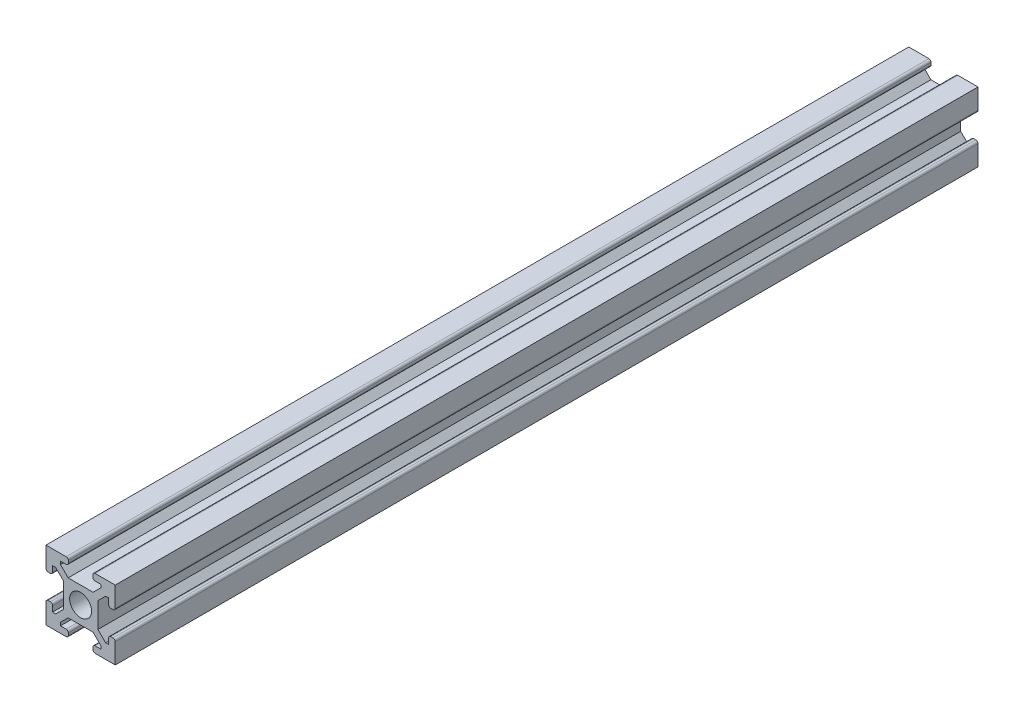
ISO-10303-21;
HEADER;
FILE_DESCRIPTION(('STEP AP214'),'2;1');
FILE_NAME('part.step','',(''),(''),'','','');
FILE_SCHEMA(('AUTOMOTIVE_DESIGN { 1 0 10303 214 1 1 1 1 }'));
ENDSEC;
DATA;
#1=APPLICATION_CONTEXT('core data for automotive mechanical design processes');
#2=APPLICATION_PROTOCOL_DEFINITION('international standard','automotive_design',2000,#1);
#3=PRODUCT_CONTEXT('',#1,'mechanical');
#4=PRODUCT('Part','Part','',(#3));
#5=PRODUCT_RELATED_PRODUCT_CATEGORY('part','',(#4));
#6=PRODUCT_DEFINITION_FORMATION('','',#4);
#7=PRODUCT_DEFINITION_CONTEXT('part definition',#1,'design');
#8=PRODUCT_DEFINITION('design','',#6,#7);
#9=PRODUCT_DEFINITION_SHAPE('','',#8);
#10=(LENGTH_UNIT() NAMED_UNIT(*) SI_UNIT(.MILLI.,.METRE.));
#11=(NAMED_UNIT(*) PLANE_ANGLE_UNIT() SI_UNIT($,.RADIAN.));
#12=(NAMED_UNIT(*) SI_UNIT($,.STERADIAN.) SOLID_ANGLE_UNIT());
#13=UNCERTAINTY_MEASURE_WITH_UNIT(LENGTH_MEASURE(1.E-05),#10,'distance_accuracy_value','');
#14=(GEOMETRIC_REPRESENTATION_CONTEXT(3) GLOBAL_UNCERTAINTY_ASSIGNED_CONTEXT((#13)) GLOBAL_UNIT_ASSIGNED_CONTEXT((#10,
#11,#12)) REPRESENTATION_CONTEXT('',''));
#15=CARTESIAN_POINT('',(0.,0.,0.));
#16=DIRECTION('',(0.,0.,1.));
#17=DIRECTION('',(1.,0.,0.));
#18=AXIS2_PLACEMENT_3D('',#15,#16,#17);
#19=CARTESIAN_POINT('',(10.033,0.,499.999));
#20=DIRECTION('',(1.,0.,0.));
#21=DIRECTION('',(0.,0.,-1.));
#22=AXIS2_PLACEMENT_3D('',#19,#20,#21);
#23=PLANE('',#22);
#24=DIRECTION('',(0.,-1.,0.));
#25=VECTOR('',#24,1.);
#26=CARTESIAN_POINT('',(10.033,0.,0.));
#27=LINE('',#26,#25);
#28=CARTESIAN_POINT('',(10.033,7.23121319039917,0.));
#29=VERTEX_POINT('',#28);
#30=CARTESIAN_POINT('',(10.033,-7.23121319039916,0.));
#31=VERTEX_POINT('',#30);
#32=EDGE_CURVE('E423',#29,#31,#27,.T.);
#33=ORIENTED_EDGE('',*,*,#32,.F.);
#34=DIRECTION('',(0.,0.,-1.));
#35=VECTOR('',#34,1.);
#36=CARTESIAN_POINT('',(10.033,7.23121319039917,499.999));
#37=LINE('',#36,#35);
#38=CARTESIAN_POINT('',(10.033,7.23121319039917,499.999));
#39=VERTEX_POINT('',#38);
#40=EDGE_CURVE('E417',#39,#29,#37,.T.);
#41=ORIENTED_EDGE('',*,*,#40,.F.);
#42=DIRECTION('',(0.,-1.,0.));
#43=VECTOR('',#42,1.);
#44=CARTESIAN_POINT('',(10.033,0.,499.999));
#45=LINE('',#44,#43);
#46=CARTESIAN_POINT('',(10.033,-7.23121319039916,499.999));
#47=VERTEX_POINT('',#46);
#48=EDGE_CURVE('E420',#39,#47,#45,.T.);
#49=ORIENTED_EDGE('',*,*,#48,.T.);
#50=DIRECTION('',(0.,0.,-1.));
#51=VECTOR('',#50,1.);
#52=CARTESIAN_POINT('',(10.033,-7.23121319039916,499.999));
#53=LINE('',#52,#51);
#54=EDGE_CURVE('E604',#47,#31,#53,.T.);
#55=ORIENTED_EDGE('',*,*,#54,.T.);
#56=EDGE_LOOP('',(#33,#41,#49,#55));
#57=FACE_BOUND('',#56,.T.);
#58=ADVANCED_FACE('F37',(#57),#23,.T.);
#59=CARTESIAN_POINT('',(1.40089340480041,-1.40089340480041,499.999));
#60=DIRECTION('',(-0.707106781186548,0.707106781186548,0.));
#61=DIRECTION('',(-0.707106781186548,-0.707106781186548,0.));
#62=AXIS2_PLACEMENT_3D('',#59,#60,#61);
#63=PLANE('',#62);
#64=DIRECTION('',(0.707106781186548,0.707106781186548,0.));
#65=VECTOR('',#64,1.);
#66=CARTESIAN_POINT('',(1.40089340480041,-1.40089340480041,0.));
#67=LINE('',#66,#65);
#68=CARTESIAN_POINT('',(14.478,11.6762131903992,0.));
#69=VERTEX_POINT('',#68);
#70=EDGE_CURVE('E607',#29,#69,#67,.T.);
#71=ORIENTED_EDGE('',*,*,#70,.T.);
#72=DIRECTION('',(0.,0.,-1.));
#73=VECTOR('',#72,1.);
#74=CARTESIAN_POINT('',(14.478,11.6762131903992,499.999));
#75=LINE('',#74,#73);
#76=CARTESIAN_POINT('',(14.478,11.6762131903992,499.999));
#77=VERTEX_POINT('',#76);
#78=EDGE_CURVE('E428',#77,#69,#75,.T.);
#79=ORIENTED_EDGE('',*,*,#78,.F.);
#80=DIRECTION('',(0.707106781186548,0.707106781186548,0.));
#81=VECTOR('',#80,1.);
#82=CARTESIAN_POINT('',(1.40089340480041,-1.40089340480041,499.999));
#83=LINE('',#82,#81);
#84=EDGE_CURVE('E431',#39,#77,#83,.T.);
#85=ORIENTED_EDGE('',*,*,#84,.F.);
#86=ORIENTED_EDGE('',*,*,#40,.T.);
#87=EDGE_LOOP('',(#71,#79,#85,#86));
#88=FACE_BOUND('',#87,.T.);
#89=ADVANCED_FACE('F432',(#88),#63,.F.);
#90=CARTESIAN_POINT('',(1.02528127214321E-13,11.6762131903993,499.999));
#91=DIRECTION('',(0.,1.,0.));
#92=DIRECTION('',(-1.,0.,0.));
#93=AXIS2_PLACEMENT_3D('',#90,#91,#92);
#94=PLANE('',#93);
#95=DIRECTION('',(1.,0.,0.));
#96=VECTOR('',#95,1.);
#97=CARTESIAN_POINT('',(1.02528127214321E-13,11.6762131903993,0.));
#98=LINE('',#97,#96);
#99=CARTESIAN_POINT('',(16.256,11.6762131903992,0.));
#100=VERTEX_POINT('',#99);
#101=EDGE_CURVE('E610',#69,#100,#98,.T.);
#102=ORIENTED_EDGE('',*,*,#101,.T.);
#103=DIRECTION('',(0.,0.,-1.));
#104=VECTOR('',#103,1.);
#105=CARTESIAN_POINT('',(16.256,11.6762131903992,499.999));
#106=LINE('',#105,#104);
#107=CARTESIAN_POINT('',(16.256,11.6762131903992,499.999));
#108=VERTEX_POINT('',#107);
#109=EDGE_CURVE('E849',#108,#100,#106,.T.);
#110=ORIENTED_EDGE('',*,*,#109,.F.);
#111=DIRECTION('',(1.,0.,0.));
#112=VECTOR('',#111,1.);
#113=CARTESIAN_POINT('',(1.02528127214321E-13,11.6762131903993,499.999));
#114=LINE('',#113,#112);
#115=EDGE_CURVE('E437',#77,#108,#114,.T.);
#116=ORIENTED_EDGE('',*,*,#115,.F.);
#117=ORIENTED_EDGE('',*,*,#78,.T.);
#118=EDGE_LOOP('',(#102,#110,#116,#117));
#119=FACE_BOUND('',#118,.T.);
#120=ADVANCED_FACE('F1236',(#119),#94,.F.);
#121=CARTESIAN_POINT('',(16.256,0.,499.999));
#122=DIRECTION('',(-1.,0.,0.));
#123=DIRECTION('',(0.,-1.,0.));
#124=AXIS2_PLACEMENT_3D('',#121,#122,#123);
#125=PLANE('',#124);
#126=DIRECTION('',(0.,1.,0.));
#127=VECTOR('',#126,1.);
#128=CARTESIAN_POINT('',(16.256,0.,0.));
#129=LINE('',#128,#127);
#130=CARTESIAN_POINT('',(16.256,8.37421319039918,0.));
#131=VERTEX_POINT('',#130);
#132=EDGE_CURVE('E614',#131,#100,#129,.T.);
#133=ORIENTED_EDGE('',*,*,#132,.F.);
#134=DIRECTION('',(0.,0.,-1.));
#135=VECTOR('',#134,1.);
#136=CARTESIAN_POINT('',(16.256,8.37421319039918,499.999));
#137=LINE('',#136,#135);
#138=CARTESIAN_POINT('',(16.256,8.37421319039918,499.999));
#139=VERTEX_POINT('',#138);
#140=EDGE_CURVE('E1015',#131,#139,#137,.F.);
#141=ORIENTED_EDGE('',*,*,#140,.T.);
#142=DIRECTION('',(0.,1.,0.));
#143=VECTOR('',#142,1.);
#144=CARTESIAN_POINT('',(16.256,0.,499.999));
#145=LINE('',#144,#143);
#146=EDGE_CURVE('E455',#139,#108,#145,.T.);
#147=ORIENTED_EDGE('',*,*,#146,.T.);
#148=ORIENTED_EDGE('',*,*,#109,.T.);
#149=EDGE_LOOP('',(#133,#141,#147,#148));
#150=FACE_BOUND('',#149,.T.);
#151=ADVANCED_FACE('F1663',(#150),#125,.T.);
#152=CARTESIAN_POINT('',(0.,7.10421319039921,499.999));
#153=DIRECTION('',(0.,-1.,0.));
#154=DIRECTION('',(1.,0.,0.));
#155=AXIS2_PLACEMENT_3D('',#152,#153,#154);
#156=PLANE('',#155);
#157=DIRECTION('',(-1.,0.,0.));
#158=VECTOR('',#157,1.);
#159=CARTESIAN_POINT('',(0.,7.10421319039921,0.));
#160=LINE('',#159,#158);
#161=CARTESIAN_POINT('',(18.796,7.10421319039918,0.));
#162=VERTEX_POINT('',#161);
#163=CARTESIAN_POINT('',(17.526,7.10421319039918,0.));
#164=VERTEX_POINT('',#163);
#165=EDGE_CURVE('E617',#162,#164,#160,.T.);
#166=ORIENTED_EDGE('',*,*,#165,.F.);
#167=DIRECTION('',(0.,0.,-1.));
#168=VECTOR('',#167,1.);
#169=CARTESIAN_POINT('',(18.796,7.10421319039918,499.999));
#170=LINE('',#169,#168);
#171=CARTESIAN_POINT('',(18.796,7.10421319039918,499.999));
#172=VERTEX_POINT('',#171);
#173=EDGE_CURVE('E1012',#162,#172,#170,.F.);
#174=ORIENTED_EDGE('',*,*,#173,.T.);
#175=DIRECTION('',(-1.,0.,0.));
#176=VECTOR('',#175,1.);
#177=CARTESIAN_POINT('',(0.,7.10421319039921,499.999));
#178=LINE('',#177,#176);
#179=CARTESIAN_POINT('',(17.526,7.10421319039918,499.999));
#180=VERTEX_POINT('',#179);
#181=EDGE_CURVE('E458',#172,#180,#178,.T.);
#182=ORIENTED_EDGE('',*,*,#181,.T.);
#183=DIRECTION('',(0.,0.,-1.));
#184=VECTOR('',#183,1.);
#185=CARTESIAN_POINT('',(17.526,7.10421319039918,499.999));
#186=LINE('',#185,#184);
#187=EDGE_CURVE('E1008',#180,#164,#186,.T.);
#188=ORIENTED_EDGE('',*,*,#187,.T.);
#189=EDGE_LOOP('',(#166,#174,#182,#188));
#190=FACE_BOUND('',#189,.T.);
#191=ADVANCED_FACE('F1248',(#190),#156,.T.);
#192=CARTESIAN_POINT('',(20.066,0.,499.999));
#193=DIRECTION('',(1.,0.,0.));
#194=DIRECTION('',(0.,0.,-1.));
#195=AXIS2_PLACEMENT_3D('',#192,#193,#194);
#196=PLANE('',#195);
#197=DIRECTION('',(0.,-1.,0.));
#198=VECTOR('',#197,1.);
#199=CARTESIAN_POINT('',(20.066,0.,499.999));
#200=LINE('',#199,#198);
#201=CARTESIAN_POINT('',(20.066,20.066,499.999));
#202=VERTEX_POINT('',#201);
#203=CARTESIAN_POINT('',(20.066,8.37421319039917,499.999));
#204=VERTEX_POINT('',#203);
#205=EDGE_CURVE('E462',#202,#204,#200,.T.);
#206=ORIENTED_EDGE('',*,*,#205,.T.);
#207=DIRECTION('',(0.,0.,-1.));
#208=VECTOR('',#207,1.);
#209=CARTESIAN_POINT('',(20.066,8.37421319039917,499.999));
#210=LINE('',#209,#208);
#211=CARTESIAN_POINT('',(20.066,8.37421319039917,0.));
#212=VERTEX_POINT('',#211);
#213=EDGE_CURVE('E1004',#204,#212,#210,.T.);
#214=ORIENTED_EDGE('',*,*,#213,.T.);
#215=DIRECTION('',(0.,-1.,0.));
#216=VECTOR('',#215,1.);
#217=CARTESIAN_POINT('',(20.066,0.,0.));
#218=LINE('',#217,#216);
#219=CARTESIAN_POINT('',(20.066,20.066,0.));
#220=VERTEX_POINT('',#219);
#221=EDGE_CURVE('E621',#220,#212,#218,.T.);
#222=ORIENTED_EDGE('',*,*,#221,.F.);
#223=DIRECTION('',(0.,0.,-1.));
#224=VECTOR('',#223,1.);
#225=CARTESIAN_POINT('',(20.066,20.066,499.999));
#226=LINE('',#225,#224);
#227=EDGE_CURVE('E845',#202,#220,#226,.T.);
#228=ORIENTED_EDGE('',*,*,#227,.F.);
#229=EDGE_LOOP('',(#206,#214,#222,#228));
#230=FACE_BOUND('',#229,.T.);
#231=ADVANCED_FACE('F1257',(#230),#196,.T.);
#232=CARTESIAN_POINT('',(0.,20.066,499.999));
#233=DIRECTION('',(0.,1.,0.));
#234=DIRECTION('',(0.,0.,1.));
#235=AXIS2_PLACEMENT_3D('',#232,#233,#234);
#236=PLANE('',#235);
#237=DIRECTION('',(1.,0.,0.));
#238=VECTOR('',#237,1.);
#239=CARTESIAN_POINT('',(0.,20.066,0.));
#240=LINE('',#239,#238);
#241=CARTESIAN_POINT('',(8.37421319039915,20.066,0.));
#242=VERTEX_POINT('',#241);
#243=EDGE_CURVE('E625',#242,#220,#240,.T.);
#244=ORIENTED_EDGE('',*,*,#243,.F.);
#245=DIRECTION('',(0.,0.,-1.));
#246=VECTOR('',#245,1.);
#247=CARTESIAN_POINT('',(8.37421319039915,20.066,499.999));
#248=LINE('',#247,#246);
#249=CARTESIAN_POINT('',(8.37421319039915,20.066,499.999));
#250=VERTEX_POINT('',#249);
#251=EDGE_CURVE('E1029',#242,#250,#248,.F.);
#252=ORIENTED_EDGE('',*,*,#251,.T.);
#253=DIRECTION('',(1.,0.,0.));
#254=VECTOR('',#253,1.);
#255=CARTESIAN_POINT('',(0.,20.066,499.999));
#256=LINE('',#255,#254);
#257=EDGE_CURVE('E466',#250,#202,#256,.T.);
#258=ORIENTED_EDGE('',*,*,#257,.T.);
#259=ORIENTED_EDGE('',*,*,#227,.T.);
#260=EDGE_LOOP('',(#244,#252,#258,#259));
#261=FACE_BOUND('',#260,.T.);
#262=ADVANCED_FACE('F1638',(#261),#236,.T.);
#263=CARTESIAN_POINT('',(7.10421319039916,0.,499.999));
#264=DIRECTION('',(1.,0.,0.));
#265=DIRECTION('',(0.,1.,0.));
#266=AXIS2_PLACEMENT_3D('',#263,#264,#265);
#267=PLANE('',#266);
#268=DIRECTION('',(0.,-1.,0.));
#269=VECTOR('',#268,1.);
#270=CARTESIAN_POINT('',(7.10421319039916,0.,0.));
#271=LINE('',#270,#269);
#272=CARTESIAN_POINT('',(7.10421319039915,18.796,0.));
#273=VERTEX_POINT('',#272);
#274=CARTESIAN_POINT('',(7.10421319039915,17.526,0.));
#275=VERTEX_POINT('',#274);
#276=EDGE_CURVE('E628',#273,#275,#271,.T.);
#277=ORIENTED_EDGE('',*,*,#276,.T.);
#278=DIRECTION('',(0.,0.,-1.));
#279=VECTOR('',#278,1.);
#280=CARTESIAN_POINT('',(7.10421319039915,17.526,499.999));
#281=LINE('',#280,#279);
#282=CARTESIAN_POINT('',(7.10421319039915,17.526,499.999));
#283=VERTEX_POINT('',#282);
#284=EDGE_CURVE('E1026',#275,#283,#281,.F.);
#285=ORIENTED_EDGE('',*,*,#284,.T.);
#286=DIRECTION('',(0.,-1.,0.));
#287=VECTOR('',#286,1.);
#288=CARTESIAN_POINT('',(7.10421319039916,0.,499.999));
#289=LINE('',#288,#287);
#290=CARTESIAN_POINT('',(7.10421319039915,18.796,499.999));
#291=VERTEX_POINT('',#290);
#292=EDGE_CURVE('E469',#291,#283,#289,.T.);
#293=ORIENTED_EDGE('',*,*,#292,.F.);
#294=DIRECTION('',(0.,0.,-1.));
#295=VECTOR('',#294,1.);
#296=CARTESIAN_POINT('',(7.10421319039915,18.796,0.));
#297=LINE('',#296,#295);
#298=EDGE_CURVE('E1022',#291,#273,#297,.T.);
#299=ORIENTED_EDGE('',*,*,#298,.T.);
#300=EDGE_LOOP('',(#277,#285,#293,#299));
#301=FACE_BOUND('',#300,.T.);
#302=ADVANCED_FACE('F1270',(#301),#267,.F.);
#303=CARTESIAN_POINT('',(0.,16.256,499.999));
#304=DIRECTION('',(0.,1.,0.));
#305=DIRECTION('',(0.,0.,1.));
#306=AXIS2_PLACEMENT_3D('',#303,#304,#305);
#307=PLANE('',#306);
#308=DIRECTION('',(1.,0.,0.));
#309=VECTOR('',#308,1.);
#310=CARTESIAN_POINT('',(0.,16.256,499.999));
#311=LINE('',#310,#309);
#312=CARTESIAN_POINT('',(8.37421319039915,16.256,499.999));
#313=VERTEX_POINT('',#312);
#314=CARTESIAN_POINT('',(11.6762131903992,16.256,499.999));
#315=VERTEX_POINT('',#314);
#316=EDGE_CURVE('E473',#313,#315,#311,.T.);
#317=ORIENTED_EDGE('',*,*,#316,.F.);
#318=DIRECTION('',(0.,0.,-1.));
#319=VECTOR('',#318,1.);
#320=CARTESIAN_POINT('',(8.37421319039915,16.256,499.999));
#321=LINE('',#320,#319);
#322=CARTESIAN_POINT('',(8.37421319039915,16.256,0.));
#323=VERTEX_POINT('',#322);
#324=EDGE_CURVE('E1018',#313,#323,#321,.T.);
#325=ORIENTED_EDGE('',*,*,#324,.T.);
#326=DIRECTION('',(1.,0.,0.));
#327=VECTOR('',#326,1.);
#328=CARTESIAN_POINT('',(0.,16.256,0.));
#329=LINE('',#328,#327);
#330=CARTESIAN_POINT('',(11.6762131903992,16.256,0.));
#331=VERTEX_POINT('',#330);
#332=EDGE_CURVE('E632',#323,#331,#329,.T.);
#333=ORIENTED_EDGE('',*,*,#332,.T.);
#334=DIRECTION('',(0.,0.,-1.));
#335=VECTOR('',#334,1.);
#336=CARTESIAN_POINT('',(11.6762131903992,16.256,499.999));
#337=LINE('',#336,#335);
#338=EDGE_CURVE('E841',#315,#331,#337,.T.);
#339=ORIENTED_EDGE('',*,*,#338,.F.);
#340=EDGE_LOOP('',(#317,#325,#333,#339));
#341=FACE_BOUND('',#340,.T.);
#342=ADVANCED_FACE('F1280',(#341),#307,.F.);
#343=CARTESIAN_POINT('',(11.6762131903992,0.,499.999));
#344=DIRECTION('',(-1.,0.,0.));
#345=DIRECTION('',(0.,0.,1.));
#346=AXIS2_PLACEMENT_3D('',#343,#344,#345);
#347=PLANE('',#346);
#348=DIRECTION('',(0.,1.,0.));
#349=VECTOR('',#348,1.);
#350=CARTESIAN_POINT('',(11.6762131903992,0.,0.));
#351=LINE('',#350,#349);
#352=CARTESIAN_POINT('',(11.6762131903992,14.478,0.));
#353=VERTEX_POINT('',#352);
#354=EDGE_CURVE('E635',#353,#331,#351,.T.);
#355=ORIENTED_EDGE('',*,*,#354,.F.);
#356=DIRECTION('',(0.,0.,-1.));
#357=VECTOR('',#356,1.);
#358=CARTESIAN_POINT('',(11.6762131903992,14.478,499.999));
#359=LINE('',#358,#357);
#360=CARTESIAN_POINT('',(11.6762131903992,14.478,499.999));
#361=VERTEX_POINT('',#360);
#362=EDGE_CURVE('E838',#361,#353,#359,.T.);
#363=ORIENTED_EDGE('',*,*,#362,.F.);
#364=DIRECTION('',(0.,1.,0.));
#365=VECTOR('',#364,1.);
#366=CARTESIAN_POINT('',(11.6762131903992,0.,499.999));
#367=LINE('',#366,#365);
#368=EDGE_CURVE('E476',#361,#315,#367,.T.);
#369=ORIENTED_EDGE('',*,*,#368,.T.);
#370=ORIENTED_EDGE('',*,*,#338,.T.);
#371=EDGE_LOOP('',(#355,#363,#369,#370));
#372=FACE_BOUND('',#371,.T.);
#373=ADVANCED_FACE('F1301',(#372),#347,.T.);
#374=CARTESIAN_POINT('',(-1.40089340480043,1.40089340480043,499.999));
#375=DIRECTION('',(-0.707106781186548,0.707106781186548,0.));
#376=DIRECTION('',(-0.707106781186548,-0.707106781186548,0.));
#377=AXIS2_PLACEMENT_3D('',#374,#375,#376);
#378=PLANE('',#377);
#379=DIRECTION('',(0.707106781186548,0.707106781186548,0.));
#380=VECTOR('',#379,1.);
#381=CARTESIAN_POINT('',(-1.40089340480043,1.40089340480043,0.));
#382=LINE('',#381,#380);
#383=CARTESIAN_POINT('',(7.23121319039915,10.033,0.));
#384=VERTEX_POINT('',#383);
#385=EDGE_CURVE('E639',#384,#353,#382,.T.);
#386=ORIENTED_EDGE('',*,*,#385,.F.);
#387=DIRECTION('',(0.,0.,-1.));
#388=VECTOR('',#387,1.);
#389=CARTESIAN_POINT('',(7.23121319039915,10.033,499.999));
#390=LINE('',#389,#388);
#391=CARTESIAN_POINT('',(7.23121319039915,10.033,499.999));
#392=VERTEX_POINT('',#391);
#393=EDGE_CURVE('E835',#392,#384,#390,.T.);
#394=ORIENTED_EDGE('',*,*,#393,.F.);
#395=DIRECTION('',(0.707106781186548,0.707106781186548,0.));
#396=VECTOR('',#395,1.);
#397=CARTESIAN_POINT('',(-1.40089340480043,1.40089340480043,499.999));
#398=LINE('',#397,#396);
#399=EDGE_CURVE('E480',#392,#361,#398,.T.);
#400=ORIENTED_EDGE('',*,*,#399,.T.);
#401=ORIENTED_EDGE('',*,*,#362,.T.);
#402=EDGE_LOOP('',(#386,#394,#400,#401));
#403=FACE_BOUND('',#402,.T.);
#404=ADVANCED_FACE('F1288',(#403),#378,.T.);
#405=CARTESIAN_POINT('',(0.,10.033,499.999));
#406=DIRECTION('',(0.,1.,0.));
#407=DIRECTION('',(0.,0.,1.));
#408=AXIS2_PLACEMENT_3D('',#405,#406,#407);
#409=PLANE('',#408);
#410=DIRECTION('',(1.,0.,0.));
#411=VECTOR('',#410,1.);
#412=CARTESIAN_POINT('',(0.,10.033,0.));
#413=LINE('',#412,#411);
#414=CARTESIAN_POINT('',(-7.23121319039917,10.033,0.));
#415=VERTEX_POINT('',#414);
#416=EDGE_CURVE('E643',#415,#384,#413,.T.);
#417=ORIENTED_EDGE('',*,*,#416,.F.);
#418=DIRECTION('',(0.,0.,-1.));
#419=VECTOR('',#418,1.);
#420=CARTESIAN_POINT('',(-7.23121319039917,10.033,499.999));
#421=LINE('',#420,#419);
#422=CARTESIAN_POINT('',(-7.23121319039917,10.033,499.999));
#423=VERTEX_POINT('',#422);
#424=EDGE_CURVE('E832',#423,#415,#421,.T.);
#425=ORIENTED_EDGE('',*,*,#424,.F.);
#426=DIRECTION('',(1.,0.,0.));
#427=VECTOR('',#426,1.);
#428=CARTESIAN_POINT('',(0.,10.033,499.999));
#429=LINE('',#428,#427);
#430=EDGE_CURVE('E484',#423,#392,#429,.T.);
#431=ORIENTED_EDGE('',*,*,#430,.T.);
#432=ORIENTED_EDGE('',*,*,#393,.T.);
#433=EDGE_LOOP('',(#417,#425,#431,#432));
#434=FACE_BOUND('',#433,.T.);
#435=ADVANCED_FACE('F1292',(#434),#409,.T.);
#436=CARTESIAN_POINT('',(1.40089340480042,1.40089340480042,499.999));
#437=DIRECTION('',(-0.707106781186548,-0.707106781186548,0.));
#438=DIRECTION('',(0.707106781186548,-0.707106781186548,0.));
#439=AXIS2_PLACEMENT_3D('',#436,#437,#438);
#440=PLANE('',#439);
#441=DIRECTION('',(-0.707106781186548,0.707106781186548,0.));
#442=VECTOR('',#441,1.);
#443=CARTESIAN_POINT('',(1.40089340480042,1.40089340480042,0.));
#444=LINE('',#443,#442);
#445=CARTESIAN_POINT('',(-11.6762131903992,14.478,0.));
#446=VERTEX_POINT('',#445);
#447=EDGE_CURVE('E647',#415,#446,#444,.T.);
#448=ORIENTED_EDGE('',*,*,#447,.T.);
#449=DIRECTION('',(0.,0.,-1.));
#450=VECTOR('',#449,1.);
#451=CARTESIAN_POINT('',(-11.6762131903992,14.478,499.999));
#452=LINE('',#451,#450);
#453=CARTESIAN_POINT('',(-11.6762131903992,14.478,499.999));
#454=VERTEX_POINT('',#453);
#455=EDGE_CURVE('E828',#454,#446,#452,.T.);
#456=ORIENTED_EDGE('',*,*,#455,.F.);
#457=DIRECTION('',(-0.707106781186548,0.707106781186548,0.));
#458=VECTOR('',#457,1.);
#459=CARTESIAN_POINT('',(1.40089340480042,1.40089340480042,499.999));
#460=LINE('',#459,#458);
#461=EDGE_CURVE('E488',#423,#454,#460,.T.);
#462=ORIENTED_EDGE('',*,*,#461,.F.);
#463=ORIENTED_EDGE('',*,*,#424,.T.);
#464=EDGE_LOOP('',(#448,#456,#462,#463));
#465=FACE_BOUND('',#464,.T.);
#466=ADVANCED_FACE('F1296',(#465),#440,.F.);
#467=CARTESIAN_POINT('',(-11.6762131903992,0.,499.999));
#468=DIRECTION('',(-1.,0.,0.));
#469=DIRECTION('',(0.,0.,1.));
#470=AXIS2_PLACEMENT_3D('',#467,#468,#469);
#471=PLANE('',#470);
#472=DIRECTION('',(0.,1.,0.));
#473=VECTOR('',#472,1.);
#474=CARTESIAN_POINT('',(-11.6762131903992,0.,0.));
#475=LINE('',#474,#473);
#476=CARTESIAN_POINT('',(-11.6762131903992,16.256,0.));
#477=VERTEX_POINT('',#476);
#478=EDGE_CURVE('E650',#446,#477,#475,.T.);
#479=ORIENTED_EDGE('',*,*,#478,.T.);
#480=DIRECTION('',(0.,0.,-1.));
#481=VECTOR('',#480,1.);
#482=CARTESIAN_POINT('',(-11.6762131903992,16.256,499.999));
#483=LINE('',#482,#481);
#484=CARTESIAN_POINT('',(-11.6762131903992,16.256,499.999));
#485=VERTEX_POINT('',#484);
#486=EDGE_CURVE('E824',#485,#477,#483,.T.);
#487=ORIENTED_EDGE('',*,*,#486,.F.);
#488=DIRECTION('',(0.,1.,0.));
#489=VECTOR('',#488,1.);
#490=CARTESIAN_POINT('',(-11.6762131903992,0.,499.999));
#491=LINE('',#490,#489);
#492=EDGE_CURVE('E491',#454,#485,#491,.T.);
#493=ORIENTED_EDGE('',*,*,#492,.F.);
#494=ORIENTED_EDGE('',*,*,#455,.T.);
#495=EDGE_LOOP('',(#479,#487,#493,#494));
#496=FACE_BOUND('',#495,.T.);
#497=ADVANCED_FACE('F1300',(#496),#471,.F.);
#498=CARTESIAN_POINT('',(0.,16.256,499.999));
#499=DIRECTION('',(0.,-1.,0.));
#500=DIRECTION('',(0.,0.,-1.));
#501=AXIS2_PLACEMENT_3D('',#498,#499,#500);
#502=PLANE('',#501);
#503=DIRECTION('',(-1.,0.,0.));
#504=VECTOR('',#503,1.);
#505=CARTESIAN_POINT('',(0.,16.256,0.));
#506=LINE('',#505,#504);
#507=CARTESIAN_POINT('',(-8.37421319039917,16.256,0.));
#508=VERTEX_POINT('',#507);
#509=EDGE_CURVE('E654',#508,#477,#506,.T.);
#510=ORIENTED_EDGE('',*,*,#509,.F.);
#511=DIRECTION('',(0.,0.,-1.));
#512=VECTOR('',#511,1.);
#513=CARTESIAN_POINT('',(-8.37421319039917,16.256,499.999));
#514=LINE('',#513,#512);
#515=CARTESIAN_POINT('',(-8.37421319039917,16.256,499.999));
#516=VERTEX_POINT('',#515);
#517=EDGE_CURVE('E46',#508,#516,#514,.F.);
#518=ORIENTED_EDGE('',*,*,#517,.T.);
#519=DIRECTION('',(-1.,0.,0.));
#520=VECTOR('',#519,1.);
#521=CARTESIAN_POINT('',(0.,16.256,499.999));
#522=LINE('',#521,#520);
#523=EDGE_CURVE('E495',#516,#485,#522,.T.);
#524=ORIENTED_EDGE('',*,*,#523,.T.);
#525=ORIENTED_EDGE('',*,*,#486,.T.);
#526=EDGE_LOOP('',(#510,#518,#524,#525));
#527=FACE_BOUND('',#526,.T.);
#528=ADVANCED_FACE('F1057',(#527),#502,.T.);
#529=CARTESIAN_POINT('',(-7.10421319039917,0.,499.999));
#530=DIRECTION('',(1.,0.,0.));
#531=DIRECTION('',(0.,1.,0.));
#532=AXIS2_PLACEMENT_3D('',#529,#530,#531);
#533=PLANE('',#532);
#534=DIRECTION('',(0.,-1.,0.));
#535=VECTOR('',#534,1.);
#536=CARTESIAN_POINT('',(-7.10421319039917,0.,499.999));
#537=LINE('',#536,#535);
#538=CARTESIAN_POINT('',(-7.10421319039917,18.796,499.999));
#539=VERTEX_POINT('',#538);
#540=CARTESIAN_POINT('',(-7.10421319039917,17.526,499.999));
#541=VERTEX_POINT('',#540);
#542=EDGE_CURVE('E498',#539,#541,#537,.T.);
#543=ORIENTED_EDGE('',*,*,#542,.T.);
#544=DIRECTION('',(0.,0.,-1.));
#545=VECTOR('',#544,1.);
#546=CARTESIAN_POINT('',(-7.10421319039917,17.526,499.999));
#547=LINE('',#546,#545);
#548=CARTESIAN_POINT('',(-7.10421319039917,17.526,0.));
#549=VERTEX_POINT('',#548);
#550=EDGE_CURVE('E1049',#541,#549,#547,.T.);
#551=ORIENTED_EDGE('',*,*,#550,.T.);
#552=DIRECTION('',(0.,-1.,0.));
#553=VECTOR('',#552,1.);
#554=CARTESIAN_POINT('',(-7.10421319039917,0.,0.));
#555=LINE('',#554,#553);
#556=CARTESIAN_POINT('',(-7.10421319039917,18.796,0.));
#557=VERTEX_POINT('',#556);
#558=EDGE_CURVE('E657',#557,#549,#555,.T.);
#559=ORIENTED_EDGE('',*,*,#558,.F.);
#560=DIRECTION('',(0.,0.,-1.));
#561=VECTOR('',#560,1.);
#562=CARTESIAN_POINT('',(-7.10421319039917,18.796,499.999));
#563=LINE('',#562,#561);
#564=EDGE_CURVE('E1046',#557,#539,#563,.F.);
#565=ORIENTED_EDGE('',*,*,#564,.T.);
#566=EDGE_LOOP('',(#543,#551,#559,#565));
#567=FACE_BOUND('',#566,.T.);
#568=ADVANCED_FACE('F1067',(#567),#533,.T.);
#569=CARTESIAN_POINT('',(0.,20.066,499.999));
#570=DIRECTION('',(0.,1.,0.));
#571=DIRECTION('',(0.,0.,1.));
#572=AXIS2_PLACEMENT_3D('',#569,#570,#571);
#573=PLANE('',#572);
#574=DIRECTION('',(1.,0.,0.));
#575=VECTOR('',#574,1.);
#576=CARTESIAN_POINT('',(0.,20.066,499.999));
#577=LINE('',#576,#575);
#578=CARTESIAN_POINT('',(-20.066,20.066,499.999));
#579=VERTEX_POINT('',#578);
#580=CARTESIAN_POINT('',(-8.37421319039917,20.066,499.999));
#581=VERTEX_POINT('',#580);
#582=EDGE_CURVE('E502',#579,#581,#577,.T.);
#583=ORIENTED_EDGE('',*,*,#582,.T.);
#584=DIRECTION('',(0.,0.,-1.));
#585=VECTOR('',#584,1.);
#586=CARTESIAN_POINT('',(-8.37421319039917,20.066,499.999));
#587=LINE('',#586,#585);
#588=CARTESIAN_POINT('',(-8.37421319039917,20.066,0.));
#589=VERTEX_POINT('',#588);
#590=EDGE_CURVE('E11',#581,#589,#587,.T.);
#591=ORIENTED_EDGE('',*,*,#590,.T.);
#592=DIRECTION('',(1.,0.,0.));
#593=VECTOR('',#592,1.);
#594=CARTESIAN_POINT('',(0.,20.066,0.));
#595=LINE('',#594,#593);
#596=CARTESIAN_POINT('',(-20.066,20.066,0.));
#597=VERTEX_POINT('',#596);
#598=EDGE_CURVE('E661',#597,#589,#595,.T.);
#599=ORIENTED_EDGE('',*,*,#598,.F.);
#600=DIRECTION('',(0.,0.,-1.));
#601=VECTOR('',#600,1.);
#602=CARTESIAN_POINT('',(-20.066,20.066,499.999));
#603=LINE('',#602,#601);
#604=EDGE_CURVE('E821',#579,#597,#603,.T.);
#605=ORIENTED_EDGE('',*,*,#604,.F.);
#606=EDGE_LOOP('',(#583,#591,#599,#605));
#607=FACE_BOUND('',#606,.T.);
#608=ADVANCED_FACE('F1079',(#607),#573,.T.);
#609=CARTESIAN_POINT('',(-20.066,0.,499.999));
#610=DIRECTION('',(1.,0.,0.));
#611=DIRECTION('',(0.,0.,-1.));
#612=AXIS2_PLACEMENT_3D('',#609,#610,#611);
#613=PLANE('',#612);
#614=DIRECTION('',(0.,-1.,0.));
#615=VECTOR('',#614,1.);
#616=CARTESIAN_POINT('',(-20.066,0.,0.));
#617=LINE('',#616,#615);
#618=CARTESIAN_POINT('',(-20.066,8.37421319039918,0.));
#619=VERTEX_POINT('',#618);
#620=EDGE_CURVE('E665',#597,#619,#617,.T.);
#621=ORIENTED_EDGE('',*,*,#620,.T.);
#622=DIRECTION('',(0.,0.,-1.));
#623=VECTOR('',#622,1.);
#624=CARTESIAN_POINT('',(-20.066,8.37421319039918,499.999));
#625=LINE('',#624,#623);
#626=CARTESIAN_POINT('',(-20.066,8.37421319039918,499.999));
#627=VERTEX_POINT('',#626);
#628=EDGE_CURVE('E1039',#619,#627,#625,.F.);
#629=ORIENTED_EDGE('',*,*,#628,.T.);
#630=DIRECTION('',(0.,-1.,0.));
#631=VECTOR('',#630,1.);
#632=CARTESIAN_POINT('',(-20.066,0.,499.999));
#633=LINE('',#632,#631);
#634=EDGE_CURVE('E506',#579,#627,#633,.T.);
#635=ORIENTED_EDGE('',*,*,#634,.F.);
#636=ORIENTED_EDGE('',*,*,#604,.T.);
#637=EDGE_LOOP('',(#621,#629,#635,#636));
#638=FACE_BOUND('',#637,.T.);
#639=ADVANCED_FACE('F1588',(#638),#613,.F.);
#640=CARTESIAN_POINT('',(0.,7.10421319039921,499.999));
#641=DIRECTION('',(0.,1.,0.));
#642=DIRECTION('',(-1.,0.,0.));
#643=AXIS2_PLACEMENT_3D('',#640,#641,#642);
#644=PLANE('',#643);
#645=DIRECTION('',(1.,0.,0.));
#646=VECTOR('',#645,1.);
#647=CARTESIAN_POINT('',(0.,7.10421319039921,499.999));
#648=LINE('',#647,#646);
#649=CARTESIAN_POINT('',(-18.796,7.10421319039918,499.999));
#650=VERTEX_POINT('',#649);
#651=CARTESIAN_POINT('',(-17.526,7.10421319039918,499.999));
#652=VERTEX_POINT('',#651);
#653=EDGE_CURVE('E510',#650,#652,#648,.T.);
#654=ORIENTED_EDGE('',*,*,#653,.F.);
#655=DIRECTION('',(0.,0.,-1.));
#656=VECTOR('',#655,1.);
#657=CARTESIAN_POINT('',(-18.796,7.10421319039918,499.999));
#658=LINE('',#657,#656);
#659=CARTESIAN_POINT('',(-18.796,7.10421319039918,0.));
#660=VERTEX_POINT('',#659);
#661=EDGE_CURVE('E1035',#650,#660,#658,.T.);
#662=ORIENTED_EDGE('',*,*,#661,.T.);
#663=DIRECTION('',(1.,0.,0.));
#664=VECTOR('',#663,1.);
#665=CARTESIAN_POINT('',(0.,7.10421319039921,0.));
#666=LINE('',#665,#664);
#667=CARTESIAN_POINT('',(-17.526,7.10421319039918,0.));
#668=VERTEX_POINT('',#667);
#669=EDGE_CURVE('E669',#660,#668,#666,.T.);
#670=ORIENTED_EDGE('',*,*,#669,.T.);
#671=DIRECTION('',(0.,0.,-1.));
#672=VECTOR('',#671,1.);
#673=CARTESIAN_POINT('',(-17.526,7.10421319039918,499.999));
#674=LINE('',#673,#672);
#675=EDGE_CURVE('E1032',#668,#652,#674,.F.);
#676=ORIENTED_EDGE('',*,*,#675,.T.);
#677=EDGE_LOOP('',(#654,#662,#670,#676));
#678=FACE_BOUND('',#677,.T.);
#679=ADVANCED_FACE('F1091',(#678),#644,.F.);
#680=CARTESIAN_POINT('',(-16.256,0.,499.999));
#681=DIRECTION('',(-1.,0.,0.));
#682=DIRECTION('',(0.,-1.,0.));
#683=AXIS2_PLACEMENT_3D('',#680,#681,#682);
#684=PLANE('',#683);
#685=DIRECTION('',(0.,1.,0.));
#686=VECTOR('',#685,1.);
#687=CARTESIAN_POINT('',(-16.256,0.,499.999));
#688=LINE('',#687,#686);
#689=CARTESIAN_POINT('',(-16.256,8.37421319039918,499.999));
#690=VERTEX_POINT('',#689);
#691=CARTESIAN_POINT('',(-16.256,11.6762131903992,499.999));
#692=VERTEX_POINT('',#691);
#693=EDGE_CURVE('E514',#690,#692,#688,.T.);
#694=ORIENTED_EDGE('',*,*,#693,.F.);
#695=DIRECTION('',(0.,0.,-1.));
#696=VECTOR('',#695,1.);
#697=CARTESIAN_POINT('',(-16.256,8.37421319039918,499.999));
#698=LINE('',#697,#696);
#699=CARTESIAN_POINT('',(-16.256,8.37421319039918,0.));
#700=VERTEX_POINT('',#699);
#701=EDGE_CURVE('E1042',#690,#700,#698,.T.);
#702=ORIENTED_EDGE('',*,*,#701,.T.);
#703=DIRECTION('',(0.,1.,0.));
#704=VECTOR('',#703,1.);
#705=CARTESIAN_POINT('',(-16.256,0.,0.));
#706=LINE('',#705,#704);
#707=CARTESIAN_POINT('',(-16.256,11.6762131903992,0.));
#708=VERTEX_POINT('',#707);
#709=EDGE_CURVE('E673',#700,#708,#706,.T.);
#710=ORIENTED_EDGE('',*,*,#709,.T.);
#711=DIRECTION('',(0.,0.,-1.));
#712=VECTOR('',#711,1.);
#713=CARTESIAN_POINT('',(-16.256,11.6762131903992,499.999));
#714=LINE('',#713,#712);
#715=EDGE_CURVE('E817',#692,#708,#714,.T.);
#716=ORIENTED_EDGE('',*,*,#715,.F.);
#717=EDGE_LOOP('',(#694,#702,#710,#716));
#718=FACE_BOUND('',#717,.T.);
#719=ADVANCED_FACE('F1100',(#718),#684,.F.);
#720=CARTESIAN_POINT('',(-1.02528127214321E-13,11.6762131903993,499.999));
#721=DIRECTION('',(0.,-1.,0.));
#722=DIRECTION('',(1.,0.,0.));
#723=AXIS2_PLACEMENT_3D('',#720,#721,#722);
#724=PLANE('',#723);
#725=DIRECTION('',(-1.,0.,0.));
#726=VECTOR('',#725,1.);
#727=CARTESIAN_POINT('',(-1.02528127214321E-13,11.6762131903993,0.));
#728=LINE('',#727,#726);
#729=CARTESIAN_POINT('',(-14.478,11.6762131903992,0.));
#730=VERTEX_POINT('',#729);
#731=EDGE_CURVE('E676',#730,#708,#728,.T.);
#732=ORIENTED_EDGE('',*,*,#731,.F.);
#733=DIRECTION('',(0.,0.,-1.));
#734=VECTOR('',#733,1.);
#735=CARTESIAN_POINT('',(-14.478,11.6762131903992,499.999));
#736=LINE('',#735,#734);
#737=CARTESIAN_POINT('',(-14.478,11.6762131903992,499.999));
#738=VERTEX_POINT('',#737);
#739=EDGE_CURVE('E814',#738,#730,#736,.T.);
#740=ORIENTED_EDGE('',*,*,#739,.F.);
#741=DIRECTION('',(-1.,0.,0.));
#742=VECTOR('',#741,1.);
#743=CARTESIAN_POINT('',(-1.02528127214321E-13,11.6762131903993,499.999));
#744=LINE('',#743,#742);
#745=EDGE_CURVE('E517',#738,#692,#744,.T.);
#746=ORIENTED_EDGE('',*,*,#745,.T.);
#747=ORIENTED_EDGE('',*,*,#715,.T.);
#748=EDGE_LOOP('',(#732,#740,#746,#747));
#749=FACE_BOUND('',#748,.T.);
#750=ADVANCED_FACE('F1577',(#749),#724,.T.);
#751=CARTESIAN_POINT('',(-1.40089340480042,-1.40089340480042,499.999));
#752=DIRECTION('',(-0.707106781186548,-0.707106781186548,0.));
#753=DIRECTION('',(0.707106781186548,-0.707106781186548,0.));
#754=AXIS2_PLACEMENT_3D('',#751,#752,#753);
#755=PLANE('',#754);
#756=DIRECTION('',(-0.707106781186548,0.707106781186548,0.));
#757=VECTOR('',#756,1.);
#758=CARTESIAN_POINT('',(-1.40089340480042,-1.40089340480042,0.));
#759=LINE('',#758,#757);
#760=CARTESIAN_POINT('',(-10.033,7.23121319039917,0.));
#761=VERTEX_POINT('',#760);
#762=EDGE_CURVE('E680',#761,#730,#759,.T.);
#763=ORIENTED_EDGE('',*,*,#762,.F.);
#764=DIRECTION('',(0.,0.,-1.));
#765=VECTOR('',#764,1.);
#766=CARTESIAN_POINT('',(-10.033,7.23121319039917,499.999));
#767=LINE('',#766,#765);
#768=CARTESIAN_POINT('',(-10.033,7.23121319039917,499.999));
#769=VERTEX_POINT('',#768);
#770=EDGE_CURVE('E811',#769,#761,#767,.T.);
#771=ORIENTED_EDGE('',*,*,#770,.F.);
#772=DIRECTION('',(-0.707106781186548,0.707106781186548,0.));
#773=VECTOR('',#772,1.);
#774=CARTESIAN_POINT('',(-1.40089340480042,-1.40089340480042,499.999));
#775=LINE('',#774,#773);
#776=EDGE_CURVE('E521',#769,#738,#775,.T.);
#777=ORIENTED_EDGE('',*,*,#776,.T.);
#778=ORIENTED_EDGE('',*,*,#739,.T.);
#779=EDGE_LOOP('',(#763,#771,#777,#778));
#780=FACE_BOUND('',#779,.T.);
#781=ADVANCED_FACE('F1107',(#780),#755,.T.);
#782=CARTESIAN_POINT('',(-10.033,0.,499.999));
#783=DIRECTION('',(1.,0.,0.));
#784=DIRECTION('',(0.,0.,-1.));
#785=AXIS2_PLACEMENT_3D('',#782,#783,#784);
#786=PLANE('',#785);
#787=DIRECTION('',(0.,-1.,0.));
#788=VECTOR('',#787,1.);
#789=CARTESIAN_POINT('',(-10.033,0.,0.));
#790=LINE('',#789,#788);
#791=CARTESIAN_POINT('',(-10.033,-7.23121319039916,0.));
#792=VERTEX_POINT('',#791);
#793=EDGE_CURVE('E684',#761,#792,#790,.T.);
#794=ORIENTED_EDGE('',*,*,#793,.T.);
#795=DIRECTION('',(0.,0.,-1.));
#796=VECTOR('',#795,1.);
#797=CARTESIAN_POINT('',(-10.033,-7.23121319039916,499.999));
#798=LINE('',#797,#796);
#799=CARTESIAN_POINT('',(-10.033,-7.23121319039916,499.999));
#800=VERTEX_POINT('',#799);
#801=EDGE_CURVE('E807',#800,#792,#798,.T.);
#802=ORIENTED_EDGE('',*,*,#801,.F.);
#803=DIRECTION('',(0.,-1.,0.));
#804=VECTOR('',#803,1.);
#805=CARTESIAN_POINT('',(-10.033,0.,499.999));
#806=LINE('',#805,#804);
#807=EDGE_CURVE('E525',#769,#800,#806,.T.);
#808=ORIENTED_EDGE('',*,*,#807,.F.);
#809=ORIENTED_EDGE('',*,*,#770,.T.);
#810=EDGE_LOOP('',(#794,#802,#808,#809));
#811=FACE_BOUND('',#810,.T.);
#812=ADVANCED_FACE('F1113',(#811),#786,.F.);
#813=CARTESIAN_POINT('',(-1.40089340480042,1.40089340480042,499.999));
#814=DIRECTION('',(0.707106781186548,-0.707106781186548,0.));
#815=DIRECTION('',(0.707106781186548,0.707106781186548,0.));
#816=AXIS2_PLACEMENT_3D('',#813,#814,#815);
#817=PLANE('',#816);
#818=DIRECTION('',(-0.707106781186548,-0.707106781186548,0.));
#819=VECTOR('',#818,1.);
#820=CARTESIAN_POINT('',(-1.40089340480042,1.40089340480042,0.));
#821=LINE('',#820,#819);
#822=CARTESIAN_POINT('',(-14.478,-11.6762131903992,0.));
#823=VERTEX_POINT('',#822);
#824=EDGE_CURVE('E687',#792,#823,#821,.T.);
#825=ORIENTED_EDGE('',*,*,#824,.T.);
#826=DIRECTION('',(0.,0.,-1.));
#827=VECTOR('',#826,1.);
#828=CARTESIAN_POINT('',(-14.478,-11.6762131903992,499.999));
#829=LINE('',#828,#827);
#830=CARTESIAN_POINT('',(-14.478,-11.6762131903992,499.999));
#831=VERTEX_POINT('',#830);
#832=EDGE_CURVE('E803',#831,#823,#829,.T.);
#833=ORIENTED_EDGE('',*,*,#832,.F.);
#834=DIRECTION('',(-0.707106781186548,-0.707106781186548,0.));
#835=VECTOR('',#834,1.);
#836=CARTESIAN_POINT('',(-1.40089340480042,1.40089340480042,499.999));
#837=LINE('',#836,#835);
#838=EDGE_CURVE('E528',#800,#831,#837,.T.);
#839=ORIENTED_EDGE('',*,*,#838,.F.);
#840=ORIENTED_EDGE('',*,*,#801,.T.);
#841=EDGE_LOOP('',(#825,#833,#839,#840));
#842=FACE_BOUND('',#841,.T.);
#843=ADVANCED_FACE('F1120',(#842),#817,.F.);
#844=CARTESIAN_POINT('',(-1.02528127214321E-13,-11.6762131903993,499.999));
#845=DIRECTION('',(0.,-1.,0.));
#846=DIRECTION('',(1.,0.,0.));
#847=AXIS2_PLACEMENT_3D('',#844,#845,#846);
#848=PLANE('',#847);
#849=DIRECTION('',(-1.,0.,0.));
#850=VECTOR('',#849,1.);
#851=CARTESIAN_POINT('',(-1.02528127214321E-13,-11.6762131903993,0.));
#852=LINE('',#851,#850);
#853=CARTESIAN_POINT('',(-16.256,-11.6762131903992,0.));
#854=VERTEX_POINT('',#853);
#855=EDGE_CURVE('E690',#823,#854,#852,.T.);
#856=ORIENTED_EDGE('',*,*,#855,.T.);
#857=DIRECTION('',(0.,0.,-1.));
#858=VECTOR('',#857,1.);
#859=CARTESIAN_POINT('',(-16.256,-11.6762131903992,499.999));
#860=LINE('',#859,#858);
#861=CARTESIAN_POINT('',(-16.256,-11.6762131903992,499.999));
#862=VERTEX_POINT('',#861);
#863=EDGE_CURVE('E799',#862,#854,#860,.T.);
#864=ORIENTED_EDGE('',*,*,#863,.F.);
#865=DIRECTION('',(-1.,0.,0.));
#866=VECTOR('',#865,1.);
#867=CARTESIAN_POINT('',(-1.02528127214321E-13,-11.6762131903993,499.999));
#868=LINE('',#867,#866);
#869=EDGE_CURVE('E531',#831,#862,#868,.T.);
#870=ORIENTED_EDGE('',*,*,#869,.F.);
#871=ORIENTED_EDGE('',*,*,#832,.T.);
#872=EDGE_LOOP('',(#856,#864,#870,#871));
#873=FACE_BOUND('',#872,.T.);
#874=ADVANCED_FACE('F1124',(#873),#848,.F.);
#875=CARTESIAN_POINT('',(-16.256,0.,499.999));
#876=DIRECTION('',(1.,0.,0.));
#877=DIRECTION('',(0.,1.,0.));
#878=AXIS2_PLACEMENT_3D('',#875,#876,#877);
#879=PLANE('',#878);
#880=DIRECTION('',(0.,-1.,0.));
#881=VECTOR('',#880,1.);
#882=CARTESIAN_POINT('',(-16.256,0.,0.));
#883=LINE('',#882,#881);
#884=CARTESIAN_POINT('',(-16.256,-8.37421319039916,0.));
#885=VERTEX_POINT('',#884);
#886=EDGE_CURVE('E694',#885,#854,#883,.T.);
#887=ORIENTED_EDGE('',*,*,#886,.F.);
#888=DIRECTION('',(0.,0.,-1.));
#889=VECTOR('',#888,1.);
#890=CARTESIAN_POINT('',(-16.256,-8.37421319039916,499.999));
#891=LINE('',#890,#889);
#892=CARTESIAN_POINT('',(-16.256,-8.37421319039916,499.999));
#893=VERTEX_POINT('',#892);
#894=EDGE_CURVE('E960',#885,#893,#891,.F.);
#895=ORIENTED_EDGE('',*,*,#894,.T.);
#896=DIRECTION('',(0.,-1.,0.));
#897=VECTOR('',#896,1.);
#898=CARTESIAN_POINT('',(-16.256,0.,499.999));
#899=LINE('',#898,#897);
#900=EDGE_CURVE('E535',#893,#862,#899,.T.);
#901=ORIENTED_EDGE('',*,*,#900,.T.);
#902=ORIENTED_EDGE('',*,*,#863,.T.);
#903=EDGE_LOOP('',(#887,#895,#901,#902));
#904=FACE_BOUND('',#903,.T.);
#905=ADVANCED_FACE('F1127',(#904),#879,.T.);
#906=CARTESIAN_POINT('',(0.,-7.1042131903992,499.999));
#907=DIRECTION('',(0.,1.,0.));
#908=DIRECTION('',(-1.,0.,0.));
#909=AXIS2_PLACEMENT_3D('',#906,#907,#908);
#910=PLANE('',#909);
#911=DIRECTION('',(1.,0.,0.));
#912=VECTOR('',#911,1.);
#913=CARTESIAN_POINT('',(0.,-7.1042131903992,0.));
#914=LINE('',#913,#912);
#915=CARTESIAN_POINT('',(-18.796,-7.10421319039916,0.));
#916=VERTEX_POINT('',#915);
#917=CARTESIAN_POINT('',(-17.526,-7.10421319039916,0.));
#918=VERTEX_POINT('',#917);
#919=EDGE_CURVE('E697',#916,#918,#914,.T.);
#920=ORIENTED_EDGE('',*,*,#919,.F.);
#921=DIRECTION('',(0.,0.,-1.));
#922=VECTOR('',#921,1.);
#923=CARTESIAN_POINT('',(-18.796,-7.10421319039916,499.999));
#924=LINE('',#923,#922);
#925=CARTESIAN_POINT('',(-18.796,-7.10421319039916,499.999));
#926=VERTEX_POINT('',#925);
#927=EDGE_CURVE('E910',#916,#926,#924,.F.);
#928=ORIENTED_EDGE('',*,*,#927,.T.);
#929=DIRECTION('',(1.,0.,0.));
#930=VECTOR('',#929,1.);
#931=CARTESIAN_POINT('',(0.,-7.1042131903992,499.999));
#932=LINE('',#931,#930);
#933=CARTESIAN_POINT('',(-17.526,-7.10421319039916,499.999));
#934=VERTEX_POINT('',#933);
#935=EDGE_CURVE('E538',#926,#934,#932,.T.);
#936=ORIENTED_EDGE('',*,*,#935,.T.);
#937=DIRECTION('',(0.,0.,-1.));
#938=VECTOR('',#937,1.);
#939=CARTESIAN_POINT('',(-17.526,-7.10421319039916,499.999));
#940=LINE('',#939,#938);
#941=EDGE_CURVE('E906',#934,#918,#940,.T.);
#942=ORIENTED_EDGE('',*,*,#941,.T.);
#943=EDGE_LOOP('',(#920,#928,#936,#942));
#944=FACE_BOUND('',#943,.T.);
#945=ADVANCED_FACE('F1135',(#944),#910,.T.);
#946=CARTESIAN_POINT('',(-20.066,0.,499.999));
#947=DIRECTION('',(1.,0.,0.));
#948=DIRECTION('',(0.,0.,-1.));
#949=AXIS2_PLACEMENT_3D('',#946,#947,#948);
#950=PLANE('',#949);
#951=DIRECTION('',(0.,-1.,0.));
#952=VECTOR('',#951,1.);
#953=CARTESIAN_POINT('',(-20.066,0.,499.999));
#954=LINE('',#953,#952);
#955=CARTESIAN_POINT('',(-20.066,-8.37421319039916,499.999));
#956=VERTEX_POINT('',#955);
#957=CARTESIAN_POINT('',(-20.066,-20.066,499.999));
#958=VERTEX_POINT('',#957);
#959=EDGE_CURVE('E542',#956,#958,#954,.T.);
#960=ORIENTED_EDGE('',*,*,#959,.F.);
#961=DIRECTION('',(0.,0.,-1.));
#962=VECTOR('',#961,1.);
#963=CARTESIAN_POINT('',(-20.066,-8.37421319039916,0.));
#964=LINE('',#963,#962);
#965=CARTESIAN_POINT('',(-20.066,-8.37421319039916,0.));
#966=VERTEX_POINT('',#965);
#967=EDGE_CURVE('E427',#956,#966,#964,.T.);
#968=ORIENTED_EDGE('',*,*,#967,.T.);
#969=DIRECTION('',(0.,-1.,0.));
#970=VECTOR('',#969,1.);
#971=CARTESIAN_POINT('',(-20.066,0.,0.));
#972=LINE('',#971,#970);
#973=CARTESIAN_POINT('',(-20.066,-20.066,0.));
#974=VERTEX_POINT('',#973);
#975=EDGE_CURVE('E701',#966,#974,#972,.T.);
#976=ORIENTED_EDGE('',*,*,#975,.T.);
#977=DIRECTION('',(0.,0.,-1.));
#978=VECTOR('',#977,1.);
#979=CARTESIAN_POINT('',(-20.066,-20.066,499.999));
#980=LINE('',#979,#978);
#981=EDGE_CURVE('E795',#958,#974,#980,.T.);
#982=ORIENTED_EDGE('',*,*,#981,.F.);
#983=EDGE_LOOP('',(#960,#968,#976,#982));
#984=FACE_BOUND('',#983,.T.);
#985=ADVANCED_FACE('F1144',(#984),#950,.F.);
#986=CARTESIAN_POINT('',(0.,-20.066,499.999));
#987=DIRECTION('',(0.,1.,0.));
#988=DIRECTION('',(0.,0.,1.));
#989=AXIS2_PLACEMENT_3D('',#986,#987,#988);
#990=PLANE('',#989);
#991=DIRECTION('',(1.,0.,0.));
#992=VECTOR('',#991,1.);
#993=CARTESIAN_POINT('',(0.,-20.066,0.));
#994=LINE('',#993,#992);
#995=CARTESIAN_POINT('',(-8.37421319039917,-20.066,0.));
#996=VERTEX_POINT('',#995);
#997=EDGE_CURVE('E704',#974,#996,#994,.T.);
#998=ORIENTED_EDGE('',*,*,#997,.T.);
#999=DIRECTION('',(0.,0.,-1.));
#1000=VECTOR('',#999,1.);
#1001=CARTESIAN_POINT('',(-8.37421319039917,-20.066,499.999));
#1002=LINE('',#1001,#1000);
#1003=CARTESIAN_POINT('',(-8.37421319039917,-20.066,499.999));
#1004=VERTEX_POINT('',#1003);
#1005=EDGE_CURVE('E970',#996,#1004,#1002,.F.);
#1006=ORIENTED_EDGE('',*,*,#1005,.T.);
#1007=DIRECTION('',(1.,0.,0.));
#1008=VECTOR('',#1007,1.);
#1009=CARTESIAN_POINT('',(0.,-20.066,499.999));
#1010=LINE('',#1009,#1008);
#1011=EDGE_CURVE('E545',#958,#1004,#1010,.T.);
#1012=ORIENTED_EDGE('',*,*,#1011,.F.);
#1013=ORIENTED_EDGE('',*,*,#981,.T.);
#1014=EDGE_LOOP('',(#998,#1006,#1012,#1013));
#1015=FACE_BOUND('',#1014,.T.);
#1016=ADVANCED_FACE('F1534',(#1015),#990,.F.);
#1017=CARTESIAN_POINT('',(-7.10421319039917,0.,499.999));
#1018=DIRECTION('',(-1.,0.,0.));
#1019=DIRECTION('',(0.,-1.,0.));
#1020=AXIS2_PLACEMENT_3D('',#1017,#1018,#1019);
#1021=PLANE('',#1020);
#1022=DIRECTION('',(0.,1.,0.));
#1023=VECTOR('',#1022,1.);
#1024=CARTESIAN_POINT('',(-7.10421319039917,0.,499.999));
#1025=LINE('',#1024,#1023);
#1026=CARTESIAN_POINT('',(-7.10421319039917,-18.796,499.999));
#1027=VERTEX_POINT('',#1026);
#1028=CARTESIAN_POINT('',(-7.10421319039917,-17.526,499.999));
#1029=VERTEX_POINT('',#1028);
#1030=EDGE_CURVE('E549',#1027,#1029,#1025,.T.);
#1031=ORIENTED_EDGE('',*,*,#1030,.F.);
#1032=DIRECTION('',(0.,0.,-1.));
#1033=VECTOR('',#1032,1.);
#1034=CARTESIAN_POINT('',(-7.10421319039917,-18.796,499.999));
#1035=LINE('',#1034,#1033);
#1036=CARTESIAN_POINT('',(-7.10421319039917,-18.796,0.));
#1037=VERTEX_POINT('',#1036);
#1038=EDGE_CURVE('E966',#1027,#1037,#1035,.T.);
#1039=ORIENTED_EDGE('',*,*,#1038,.T.);
#1040=DIRECTION('',(0.,1.,0.));
#1041=VECTOR('',#1040,1.);
#1042=CARTESIAN_POINT('',(-7.10421319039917,0.,0.));
#1043=LINE('',#1042,#1041);
#1044=CARTESIAN_POINT('',(-7.10421319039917,-17.526,0.));
#1045=VERTEX_POINT('',#1044);
#1046=EDGE_CURVE('E708',#1037,#1045,#1043,.T.);
#1047=ORIENTED_EDGE('',*,*,#1046,.T.);
#1048=DIRECTION('',(0.,0.,-1.));
#1049=VECTOR('',#1048,1.);
#1050=CARTESIAN_POINT('',(-7.10421319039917,-17.526,499.999));
#1051=LINE('',#1050,#1049);
#1052=EDGE_CURVE('E963',#1045,#1029,#1051,.F.);
#1053=ORIENTED_EDGE('',*,*,#1052,.T.);
#1054=EDGE_LOOP('',(#1031,#1039,#1047,#1053));
#1055=FACE_BOUND('',#1054,.T.);
#1056=ADVANCED_FACE('F1156',(#1055),#1021,.F.);
#1057=CARTESIAN_POINT('',(0.,-16.256,499.999));
#1058=DIRECTION('',(0.,-1.,0.));
#1059=DIRECTION('',(0.,0.,-1.));
#1060=AXIS2_PLACEMENT_3D('',#1057,#1058,#1059);
#1061=PLANE('',#1060);
#1062=DIRECTION('',(-1.,0.,0.));
#1063=VECTOR('',#1062,1.);
#1064=CARTESIAN_POINT('',(0.,-16.256,499.999));
#1065=LINE('',#1064,#1063);
#1066=CARTESIAN_POINT('',(-8.37421319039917,-16.256,499.999));
#1067=VERTEX_POINT('',#1066);
#1068=CARTESIAN_POINT('',(-11.6762131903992,-16.256,499.999));
#1069=VERTEX_POINT('',#1068);
#1070=EDGE_CURVE('E553',#1067,#1069,#1065,.T.);
#1071=ORIENTED_EDGE('',*,*,#1070,.F.);
#1072=DIRECTION('',(0.,0.,-1.));
#1073=VECTOR('',#1072,1.);
#1074=CARTESIAN_POINT('',(-8.37421319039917,-16.256,499.999));
#1075=LINE('',#1074,#1073);
#1076=CARTESIAN_POINT('',(-8.37421319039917,-16.256,0.));
#1077=VERTEX_POINT('',#1076);
#1078=EDGE_CURVE('E973',#1067,#1077,#1075,.T.);
#1079=ORIENTED_EDGE('',*,*,#1078,.T.);
#1080=DIRECTION('',(-1.,0.,0.));
#1081=VECTOR('',#1080,1.);
#1082=CARTESIAN_POINT('',(0.,-16.256,0.));
#1083=LINE('',#1082,#1081);
#1084=CARTESIAN_POINT('',(-11.6762131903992,-16.256,0.));
#1085=VERTEX_POINT('',#1084);
#1086=EDGE_CURVE('E712',#1077,#1085,#1083,.T.);
#1087=ORIENTED_EDGE('',*,*,#1086,.T.);
#1088=DIRECTION('',(0.,0.,-1.));
#1089=VECTOR('',#1088,1.);
#1090=CARTESIAN_POINT('',(-11.6762131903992,-16.256,499.999));
#1091=LINE('',#1090,#1089);
#1092=EDGE_CURVE('E791',#1069,#1085,#1091,.T.);
#1093=ORIENTED_EDGE('',*,*,#1092,.F.);
#1094=EDGE_LOOP('',(#1071,#1079,#1087,#1093));
#1095=FACE_BOUND('',#1094,.T.);
#1096=ADVANCED_FACE('F1165',(#1095),#1061,.F.);
#1097=CARTESIAN_POINT('',(-11.6762131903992,0.,499.999));
#1098=DIRECTION('',(1.,0.,0.));
#1099=DIRECTION('',(0.,0.,-1.));
#1100=AXIS2_PLACEMENT_3D('',#1097,#1098,#1099);
#1101=PLANE('',#1100);
#1102=DIRECTION('',(0.,-1.,0.));
#1103=VECTOR('',#1102,1.);
#1104=CARTESIAN_POINT('',(-11.6762131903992,0.,0.));
#1105=LINE('',#1104,#1103);
#1106=CARTESIAN_POINT('',(-11.6762131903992,-14.478,0.));
#1107=VERTEX_POINT('',#1106);
#1108=EDGE_CURVE('E715',#1107,#1085,#1105,.T.);
#1109=ORIENTED_EDGE('',*,*,#1108,.F.);
#1110=DIRECTION('',(0.,0.,-1.));
#1111=VECTOR('',#1110,1.);
#1112=CARTESIAN_POINT('',(-11.6762131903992,-14.478,499.999));
#1113=LINE('',#1112,#1111);
#1114=CARTESIAN_POINT('',(-11.6762131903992,-14.478,499.999));
#1115=VERTEX_POINT('',#1114);
#1116=EDGE_CURVE('E788',#1115,#1107,#1113,.T.);
#1117=ORIENTED_EDGE('',*,*,#1116,.F.);
#1118=DIRECTION('',(0.,-1.,0.));
#1119=VECTOR('',#1118,1.);
#1120=CARTESIAN_POINT('',(-11.6762131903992,0.,499.999));
#1121=LINE('',#1120,#1119);
#1122=EDGE_CURVE('E556',#1115,#1069,#1121,.T.);
#1123=ORIENTED_EDGE('',*,*,#1122,.T.);
#1124=ORIENTED_EDGE('',*,*,#1092,.T.);
#1125=EDGE_LOOP('',(#1109,#1117,#1123,#1124));
#1126=FACE_BOUND('',#1125,.T.);
#1127=ADVANCED_FACE('F1523',(#1126),#1101,.T.);
#1128=CARTESIAN_POINT('',(1.40089340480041,-1.40089340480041,499.999));
#1129=DIRECTION('',(0.707106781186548,-0.707106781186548,0.));
#1130=DIRECTION('',(0.707106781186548,0.707106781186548,0.));
#1131=AXIS2_PLACEMENT_3D('',#1128,#1129,#1130);
#1132=PLANE('',#1131);
#1133=DIRECTION('',(-0.707106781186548,-0.707106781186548,0.));
#1134=VECTOR('',#1133,1.);
#1135=CARTESIAN_POINT('',(1.40089340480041,-1.40089340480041,0.));
#1136=LINE('',#1135,#1134);
#1137=CARTESIAN_POINT('',(-7.23121319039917,-10.033,0.));
#1138=VERTEX_POINT('',#1137);
#1139=EDGE_CURVE('E719',#1138,#1107,#1136,.T.);
#1140=ORIENTED_EDGE('',*,*,#1139,.F.);
#1141=DIRECTION('',(0.,0.,-1.));
#1142=VECTOR('',#1141,1.);
#1143=CARTESIAN_POINT('',(-7.23121319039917,-10.033,499.999));
#1144=LINE('',#1143,#1142);
#1145=CARTESIAN_POINT('',(-7.23121319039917,-10.033,499.999));
#1146=VERTEX_POINT('',#1145);
#1147=EDGE_CURVE('E785',#1146,#1138,#1144,.T.);
#1148=ORIENTED_EDGE('',*,*,#1147,.F.);
#1149=DIRECTION('',(-0.707106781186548,-0.707106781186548,0.));
#1150=VECTOR('',#1149,1.);
#1151=CARTESIAN_POINT('',(1.40089340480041,-1.40089340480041,499.999));
#1152=LINE('',#1151,#1150);
#1153=EDGE_CURVE('E560',#1146,#1115,#1152,.T.);
#1154=ORIENTED_EDGE('',*,*,#1153,.T.);
#1155=ORIENTED_EDGE('',*,*,#1116,.T.);
#1156=EDGE_LOOP('',(#1140,#1148,#1154,#1155));
#1157=FACE_BOUND('',#1156,.T.);
#1158=ADVANCED_FACE('F1172',(#1157),#1132,.T.);
#1159=CARTESIAN_POINT('',(0.,-10.033,499.999));
#1160=DIRECTION('',(0.,1.,0.));
#1161=DIRECTION('',(0.,0.,1.));
#1162=AXIS2_PLACEMENT_3D('',#1159,#1160,#1161);
#1163=PLANE('',#1162);
#1164=DIRECTION('',(1.,0.,0.));
#1165=VECTOR('',#1164,1.);
#1166=CARTESIAN_POINT('',(0.,-10.033,0.));
#1167=LINE('',#1166,#1165);
#1168=CARTESIAN_POINT('',(7.23121319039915,-10.033,0.));
#1169=VERTEX_POINT('',#1168);
#1170=EDGE_CURVE('E723',#1138,#1169,#1167,.T.);
#1171=ORIENTED_EDGE('',*,*,#1170,.T.);
#1172=DIRECTION('',(0.,0.,-1.));
#1173=VECTOR('',#1172,1.);
#1174=CARTESIAN_POINT('',(7.23121319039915,-10.033,499.999));
#1175=LINE('',#1174,#1173);
#1176=CARTESIAN_POINT('',(7.23121319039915,-10.033,499.999));
#1177=VERTEX_POINT('',#1176);
#1178=EDGE_CURVE('E781',#1177,#1169,#1175,.T.);
#1179=ORIENTED_EDGE('',*,*,#1178,.F.);
#1180=DIRECTION('',(1.,0.,0.));
#1181=VECTOR('',#1180,1.);
#1182=CARTESIAN_POINT('',(0.,-10.033,499.999));
#1183=LINE('',#1182,#1181);
#1184=EDGE_CURVE('E564',#1146,#1177,#1183,.T.);
#1185=ORIENTED_EDGE('',*,*,#1184,.F.);
#1186=ORIENTED_EDGE('',*,*,#1147,.T.);
#1187=EDGE_LOOP('',(#1171,#1179,#1185,#1186));
#1188=FACE_BOUND('',#1187,.T.);
#1189=ADVANCED_FACE('F1178',(#1188),#1163,.F.);
#1190=CARTESIAN_POINT('',(-1.40089340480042,-1.40089340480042,499.999));
#1191=DIRECTION('',(0.707106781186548,0.707106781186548,0.));
#1192=DIRECTION('',(-0.707106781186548,0.707106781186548,0.));
#1193=AXIS2_PLACEMENT_3D('',#1190,#1191,#1192);
#1194=PLANE('',#1193);
#1195=DIRECTION('',(0.707106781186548,-0.707106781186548,0.));
#1196=VECTOR('',#1195,1.);
#1197=CARTESIAN_POINT('',(-1.40089340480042,-1.40089340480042,0.));
#1198=LINE('',#1197,#1196);
#1199=CARTESIAN_POINT('',(11.6762131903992,-14.478,0.));
#1200=VERTEX_POINT('',#1199);
#1201=EDGE_CURVE('E726',#1169,#1200,#1198,.T.);
#1202=ORIENTED_EDGE('',*,*,#1201,.T.);
#1203=DIRECTION('',(0.,0.,-1.));
#1204=VECTOR('',#1203,1.);
#1205=CARTESIAN_POINT('',(11.6762131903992,-14.478,499.999));
#1206=LINE('',#1205,#1204);
#1207=CARTESIAN_POINT('',(11.6762131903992,-14.478,499.999));
#1208=VERTEX_POINT('',#1207);
#1209=EDGE_CURVE('E777',#1208,#1200,#1206,.T.);
#1210=ORIENTED_EDGE('',*,*,#1209,.F.);
#1211=DIRECTION('',(0.707106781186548,-0.707106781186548,0.));
#1212=VECTOR('',#1211,1.);
#1213=CARTESIAN_POINT('',(-1.40089340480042,-1.40089340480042,499.999));
#1214=LINE('',#1213,#1212);
#1215=EDGE_CURVE('E567',#1177,#1208,#1214,.T.);
#1216=ORIENTED_EDGE('',*,*,#1215,.F.);
#1217=ORIENTED_EDGE('',*,*,#1178,.T.);
#1218=EDGE_LOOP('',(#1202,#1210,#1216,#1217));
#1219=FACE_BOUND('',#1218,.T.);
#1220=ADVANCED_FACE('F1185',(#1219),#1194,.F.);
#1221=CARTESIAN_POINT('',(11.6762131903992,0.,499.999));
#1222=DIRECTION('',(1.,0.,0.));
#1223=DIRECTION('',(0.,0.,-1.));
#1224=AXIS2_PLACEMENT_3D('',#1221,#1222,#1223);
#1225=PLANE('',#1224);
#1226=DIRECTION('',(0.,-1.,0.));
#1227=VECTOR('',#1226,1.);
#1228=CARTESIAN_POINT('',(11.6762131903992,0.,0.));
#1229=LINE('',#1228,#1227);
#1230=CARTESIAN_POINT('',(11.6762131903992,-16.256,0.));
#1231=VERTEX_POINT('',#1230);
#1232=EDGE_CURVE('E729',#1200,#1231,#1229,.T.);
#1233=ORIENTED_EDGE('',*,*,#1232,.T.);
#1234=DIRECTION('',(0.,0.,-1.));
#1235=VECTOR('',#1234,1.);
#1236=CARTESIAN_POINT('',(11.6762131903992,-16.256,499.999));
#1237=LINE('',#1236,#1235);
#1238=CARTESIAN_POINT('',(11.6762131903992,-16.256,499.999));
#1239=VERTEX_POINT('',#1238);
#1240=EDGE_CURVE('E773',#1239,#1231,#1237,.T.);
#1241=ORIENTED_EDGE('',*,*,#1240,.F.);
#1242=DIRECTION('',(0.,-1.,0.));
#1243=VECTOR('',#1242,1.);
#1244=CARTESIAN_POINT('',(11.6762131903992,0.,499.999));
#1245=LINE('',#1244,#1243);
#1246=EDGE_CURVE('E570',#1208,#1239,#1245,.T.);
#1247=ORIENTED_EDGE('',*,*,#1246,.F.);
#1248=ORIENTED_EDGE('',*,*,#1209,.T.);
#1249=EDGE_LOOP('',(#1233,#1241,#1247,#1248));
#1250=FACE_BOUND('',#1249,.T.);
#1251=ADVANCED_FACE('F1189',(#1250),#1225,.F.);
#1252=CARTESIAN_POINT('',(0.,-16.256,499.999));
#1253=DIRECTION('',(0.,1.,0.));
#1254=DIRECTION('',(0.,0.,1.));
#1255=AXIS2_PLACEMENT_3D('',#1252,#1253,#1254);
#1256=PLANE('',#1255);
#1257=DIRECTION('',(1.,0.,0.));
#1258=VECTOR('',#1257,1.);
#1259=CARTESIAN_POINT('',(0.,-16.256,0.));
#1260=LINE('',#1259,#1258);
#1261=CARTESIAN_POINT('',(8.37421319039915,-16.256,0.));
#1262=VERTEX_POINT('',#1261);
#1263=EDGE_CURVE('E733',#1262,#1231,#1260,.T.);
#1264=ORIENTED_EDGE('',*,*,#1263,.F.);
#1265=DIRECTION('',(0.,0.,-1.));
#1266=VECTOR('',#1265,1.);
#1267=CARTESIAN_POINT('',(8.37421319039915,-16.256,499.999));
#1268=LINE('',#1267,#1266);
#1269=CARTESIAN_POINT('',(8.37421319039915,-16.256,499.999));
#1270=VERTEX_POINT('',#1269);
#1271=EDGE_CURVE('E988',#1262,#1270,#1268,.F.);
#1272=ORIENTED_EDGE('',*,*,#1271,.T.);
#1273=DIRECTION('',(1.,0.,0.));
#1274=VECTOR('',#1273,1.);
#1275=CARTESIAN_POINT('',(0.,-16.256,499.999));
#1276=LINE('',#1275,#1274);
#1277=EDGE_CURVE('E574',#1270,#1239,#1276,.T.);
#1278=ORIENTED_EDGE('',*,*,#1277,.T.);
#1279=ORIENTED_EDGE('',*,*,#1240,.T.);
#1280=EDGE_LOOP('',(#1264,#1272,#1278,#1279));
#1281=FACE_BOUND('',#1280,.T.);
#1282=ADVANCED_FACE('F1192',(#1281),#1256,.T.);
#1283=CARTESIAN_POINT('',(7.10421319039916,0.,499.999));
#1284=DIRECTION('',(-1.,0.,0.));
#1285=DIRECTION('',(0.,-1.,0.));
#1286=AXIS2_PLACEMENT_3D('',#1283,#1284,#1285);
#1287=PLANE('',#1286);
#1288=DIRECTION('',(0.,1.,0.));
#1289=VECTOR('',#1288,1.);
#1290=CARTESIAN_POINT('',(7.10421319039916,0.,0.));
#1291=LINE('',#1290,#1289);
#1292=CARTESIAN_POINT('',(7.10421319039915,-18.796,0.));
#1293=VERTEX_POINT('',#1292);
#1294=CARTESIAN_POINT('',(7.10421319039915,-17.526,0.));
#1295=VERTEX_POINT('',#1294);
#1296=EDGE_CURVE('E736',#1293,#1295,#1291,.T.);
#1297=ORIENTED_EDGE('',*,*,#1296,.F.);
#1298=DIRECTION('',(0.,0.,-1.));
#1299=VECTOR('',#1298,1.);
#1300=CARTESIAN_POINT('',(7.10421319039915,-18.796,499.999));
#1301=LINE('',#1300,#1299);
#1302=CARTESIAN_POINT('',(7.10421319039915,-18.796,499.999));
#1303=VERTEX_POINT('',#1302);
#1304=EDGE_CURVE('E985',#1293,#1303,#1301,.F.);
#1305=ORIENTED_EDGE('',*,*,#1304,.T.);
#1306=DIRECTION('',(0.,1.,0.));
#1307=VECTOR('',#1306,1.);
#1308=CARTESIAN_POINT('',(7.10421319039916,0.,499.999));
#1309=LINE('',#1308,#1307);
#1310=CARTESIAN_POINT('',(7.10421319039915,-17.526,499.999));
#1311=VERTEX_POINT('',#1310);
#1312=EDGE_CURVE('E577',#1303,#1311,#1309,.T.);
#1313=ORIENTED_EDGE('',*,*,#1312,.T.);
#1314=DIRECTION('',(0.,0.,-1.));
#1315=VECTOR('',#1314,1.);
#1316=CARTESIAN_POINT('',(7.10421319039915,-17.526,499.999));
#1317=LINE('',#1316,#1315);
#1318=EDGE_CURVE('E981',#1311,#1295,#1317,.T.);
#1319=ORIENTED_EDGE('',*,*,#1318,.T.);
#1320=EDGE_LOOP('',(#1297,#1305,#1313,#1319));
#1321=FACE_BOUND('',#1320,.T.);
#1322=ADVANCED_FACE('F1201',(#1321),#1287,.T.);
#1323=CARTESIAN_POINT('',(0.,-20.066,499.999));
#1324=DIRECTION('',(0.,1.,0.));
#1325=DIRECTION('',(0.,0.,1.));
#1326=AXIS2_PLACEMENT_3D('',#1323,#1324,#1325);
#1327=PLANE('',#1326);
#1328=DIRECTION('',(1.,0.,0.));
#1329=VECTOR('',#1328,1.);
#1330=CARTESIAN_POINT('',(0.,-20.066,499.999));
#1331=LINE('',#1330,#1329);
#1332=CARTESIAN_POINT('',(8.37421319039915,-20.066,499.999));
#1333=VERTEX_POINT('',#1332);
#1334=CARTESIAN_POINT('',(20.066,-20.066,499.999));
#1335=VERTEX_POINT('',#1334);
#1336=EDGE_CURVE('E581',#1333,#1335,#1331,.T.);
#1337=ORIENTED_EDGE('',*,*,#1336,.F.);
#1338=DIRECTION('',(0.,0.,-1.));
#1339=VECTOR('',#1338,1.);
#1340=CARTESIAN_POINT('',(8.37421319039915,-20.066,0.));
#1341=LINE('',#1340,#1339);
#1342=CARTESIAN_POINT('',(8.37421319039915,-20.066,0.));
#1343=VERTEX_POINT('',#1342);
#1344=EDGE_CURVE('E977',#1333,#1343,#1341,.T.);
#1345=ORIENTED_EDGE('',*,*,#1344,.T.);
#1346=DIRECTION('',(1.,0.,0.));
#1347=VECTOR('',#1346,1.);
#1348=CARTESIAN_POINT('',(0.,-20.066,0.));
#1349=LINE('',#1348,#1347);
#1350=CARTESIAN_POINT('',(20.066,-20.066,0.));
#1351=VERTEX_POINT('',#1350);
#1352=EDGE_CURVE('E740',#1343,#1351,#1349,.T.);
#1353=ORIENTED_EDGE('',*,*,#1352,.T.);
#1354=DIRECTION('',(0.,0.,-1.));
#1355=VECTOR('',#1354,1.);
#1356=CARTESIAN_POINT('',(20.066,-20.066,499.999));
#1357=LINE('',#1356,#1355);
#1358=EDGE_CURVE('E769',#1335,#1351,#1357,.T.);
#1359=ORIENTED_EDGE('',*,*,#1358,.F.);
#1360=EDGE_LOOP('',(#1337,#1345,#1353,#1359));
#1361=FACE_BOUND('',#1360,.T.);
#1362=ADVANCED_FACE('F1210',(#1361),#1327,.F.);
#1363=CARTESIAN_POINT('',(20.066,0.,499.999));
#1364=DIRECTION('',(1.,0.,0.));
#1365=DIRECTION('',(0.,0.,-1.));
#1366=AXIS2_PLACEMENT_3D('',#1363,#1364,#1365);
#1367=PLANE('',#1366);
#1368=DIRECTION('',(0.,-1.,0.));
#1369=VECTOR('',#1368,1.);
#1370=CARTESIAN_POINT('',(20.066,0.,0.));
#1371=LINE('',#1370,#1369);
#1372=CARTESIAN_POINT('',(20.066,-8.37421319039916,0.));
#1373=VERTEX_POINT('',#1372);
#1374=EDGE_CURVE('E743',#1373,#1351,#1371,.T.);
#1375=ORIENTED_EDGE('',*,*,#1374,.F.);
#1376=DIRECTION('',(0.,0.,-1.));
#1377=VECTOR('',#1376,1.);
#1378=CARTESIAN_POINT('',(20.066,-8.37421319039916,499.999));
#1379=LINE('',#1378,#1377);
#1380=CARTESIAN_POINT('',(20.066,-8.37421319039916,499.999));
#1381=VERTEX_POINT('',#1380);
#1382=EDGE_CURVE('E1001',#1373,#1381,#1379,.F.);
#1383=ORIENTED_EDGE('',*,*,#1382,.T.);
#1384=DIRECTION('',(0.,-1.,0.));
#1385=VECTOR('',#1384,1.);
#1386=CARTESIAN_POINT('',(20.066,0.,499.999));
#1387=LINE('',#1386,#1385);
#1388=EDGE_CURVE('E585',#1381,#1335,#1387,.T.);
#1389=ORIENTED_EDGE('',*,*,#1388,.T.);
#1390=ORIENTED_EDGE('',*,*,#1358,.T.);
#1391=EDGE_LOOP('',(#1375,#1383,#1389,#1390));
#1392=FACE_BOUND('',#1391,.T.);
#1393=ADVANCED_FACE('F1480',(#1392),#1367,.T.);
#1394=CARTESIAN_POINT('',(0.,-7.1042131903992,499.999));
#1395=DIRECTION('',(0.,-1.,0.));
#1396=DIRECTION('',(1.,0.,0.));
#1397=AXIS2_PLACEMENT_3D('',#1394,#1395,#1396);
#1398=PLANE('',#1397);
#1399=DIRECTION('',(-1.,0.,0.));
#1400=VECTOR('',#1399,1.);
#1401=CARTESIAN_POINT('',(0.,-7.1042131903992,0.));
#1402=LINE('',#1401,#1400);
#1403=CARTESIAN_POINT('',(18.796,-7.10421319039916,0.));
#1404=VERTEX_POINT('',#1403);
#1405=CARTESIAN_POINT('',(17.526,-7.10421319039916,0.));
#1406=VERTEX_POINT('',#1405);
#1407=EDGE_CURVE('E747',#1404,#1406,#1402,.T.);
#1408=ORIENTED_EDGE('',*,*,#1407,.T.);
#1409=DIRECTION('',(0.,0.,-1.));
#1410=VECTOR('',#1409,1.);
#1411=CARTESIAN_POINT('',(17.526,-7.10421319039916,499.999));
#1412=LINE('',#1411,#1410);
#1413=CARTESIAN_POINT('',(17.526,-7.10421319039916,499.999));
#1414=VERTEX_POINT('',#1413);
#1415=EDGE_CURVE('E61',#1406,#1414,#1412,.F.);
#1416=ORIENTED_EDGE('',*,*,#1415,.T.);
#1417=DIRECTION('',(-1.,0.,0.));
#1418=VECTOR('',#1417,1.);
#1419=CARTESIAN_POINT('',(0.,-7.1042131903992,499.999));
#1420=LINE('',#1419,#1418);
#1421=CARTESIAN_POINT('',(18.796,-7.10421319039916,499.999));
#1422=VERTEX_POINT('',#1421);
#1423=EDGE_CURVE('E588',#1422,#1414,#1420,.T.);
#1424=ORIENTED_EDGE('',*,*,#1423,.F.);
#1425=DIRECTION('',(0.,0.,-1.));
#1426=VECTOR('',#1425,1.);
#1427=CARTESIAN_POINT('',(18.796,-7.10421319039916,0.));
#1428=LINE('',#1427,#1426);
#1429=EDGE_CURVE('E995',#1422,#1404,#1428,.T.);
#1430=ORIENTED_EDGE('',*,*,#1429,.T.);
#1431=EDGE_LOOP('',(#1408,#1416,#1424,#1430));
#1432=FACE_BOUND('',#1431,.T.);
#1433=ADVANCED_FACE('F1220',(#1432),#1398,.F.);
#1434=CARTESIAN_POINT('',(16.256,0.,499.999));
#1435=DIRECTION('',(1.,0.,0.));
#1436=DIRECTION('',(0.,1.,0.));
#1437=AXIS2_PLACEMENT_3D('',#1434,#1435,#1436);
#1438=PLANE('',#1437);
#1439=DIRECTION('',(0.,-1.,0.));
#1440=VECTOR('',#1439,1.);
#1441=CARTESIAN_POINT('',(16.256,0.,499.999));
#1442=LINE('',#1441,#1440);
#1443=CARTESIAN_POINT('',(16.256,-8.37421319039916,499.999));
#1444=VERTEX_POINT('',#1443);
#1445=CARTESIAN_POINT('',(16.256,-11.6762131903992,499.999));
#1446=VERTEX_POINT('',#1445);
#1447=EDGE_CURVE('E591',#1444,#1446,#1442,.T.);
#1448=ORIENTED_EDGE('',*,*,#1447,.F.);
#1449=DIRECTION('',(0.,0.,-1.));
#1450=VECTOR('',#1449,1.);
#1451=CARTESIAN_POINT('',(16.256,-8.37421319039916,499.999));
#1452=LINE('',#1451,#1450);
#1453=CARTESIAN_POINT('',(16.256,-8.37421319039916,0.));
#1454=VERTEX_POINT('',#1453);
#1455=EDGE_CURVE('E991',#1444,#1454,#1452,.T.);
#1456=ORIENTED_EDGE('',*,*,#1455,.T.);
#1457=DIRECTION('',(0.,-1.,0.));
#1458=VECTOR('',#1457,1.);
#1459=CARTESIAN_POINT('',(16.256,0.,0.));
#1460=LINE('',#1459,#1458);
#1461=CARTESIAN_POINT('',(16.256,-11.6762131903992,0.));
#1462=VERTEX_POINT('',#1461);
#1463=EDGE_CURVE('E750',#1454,#1462,#1460,.T.);
#1464=ORIENTED_EDGE('',*,*,#1463,.T.);
#1465=DIRECTION('',(0.,0.,-1.));
#1466=VECTOR('',#1465,1.);
#1467=CARTESIAN_POINT('',(16.256,-11.6762131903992,499.999));
#1468=LINE('',#1467,#1466);
#1469=EDGE_CURVE('E765',#1446,#1462,#1468,.T.);
#1470=ORIENTED_EDGE('',*,*,#1469,.F.);
#1471=EDGE_LOOP('',(#1448,#1456,#1464,#1470));
#1472=FACE_BOUND('',#1471,.T.);
#1473=ADVANCED_FACE('F1227',(#1472),#1438,.F.);
#1474=CARTESIAN_POINT('',(1.02528127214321E-13,-11.6762131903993,499.999));
#1475=DIRECTION('',(0.,1.,0.));
#1476=DIRECTION('',(-1.,0.,0.));
#1477=AXIS2_PLACEMENT_3D('',#1474,#1475,#1476);
#1478=PLANE('',#1477);
#1479=DIRECTION('',(1.,0.,0.));
#1480=VECTOR('',#1479,1.);
#1481=CARTESIAN_POINT('',(1.02528127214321E-13,-11.6762131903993,0.));
#1482=LINE('',#1481,#1480);
#1483=CARTESIAN_POINT('',(14.478,-11.6762131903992,0.));
#1484=VERTEX_POINT('',#1483);
#1485=EDGE_CURVE('E753',#1484,#1462,#1482,.T.);
#1486=ORIENTED_EDGE('',*,*,#1485,.F.);
#1487=DIRECTION('',(0.,0.,-1.));
#1488=VECTOR('',#1487,1.);
#1489=CARTESIAN_POINT('',(14.478,-11.6762131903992,499.999));
#1490=LINE('',#1489,#1488);
#1491=CARTESIAN_POINT('',(14.478,-11.6762131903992,499.999));
#1492=VERTEX_POINT('',#1491);
#1493=EDGE_CURVE('E762',#1492,#1484,#1490,.T.);
#1494=ORIENTED_EDGE('',*,*,#1493,.F.);
#1495=DIRECTION('',(1.,0.,0.));
#1496=VECTOR('',#1495,1.);
#1497=CARTESIAN_POINT('',(1.02528127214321E-13,-11.6762131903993,499.999));
#1498=LINE('',#1497,#1496);
#1499=EDGE_CURVE('E594',#1492,#1446,#1498,.T.);
#1500=ORIENTED_EDGE('',*,*,#1499,.T.);
#1501=ORIENTED_EDGE('',*,*,#1469,.T.);
#1502=EDGE_LOOP('',(#1486,#1494,#1500,#1501));
#1503=FACE_BOUND('',#1502,.T.);
#1504=ADVANCED_FACE('F1469',(#1503),#1478,.T.);
#1505=CARTESIAN_POINT('',(1.40089340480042,1.40089340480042,499.999));
#1506=DIRECTION('',(0.707106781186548,0.707106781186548,0.));
#1507=DIRECTION('',(-0.707106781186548,0.707106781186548,0.));
#1508=AXIS2_PLACEMENT_3D('',#1505,#1506,#1507);
#1509=PLANE('',#1508);
#1510=DIRECTION('',(0.707106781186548,-0.707106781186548,0.));
#1511=VECTOR('',#1510,1.);
#1512=CARTESIAN_POINT('',(1.40089340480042,1.40089340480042,0.));
#1513=LINE('',#1512,#1511);
#1514=EDGE_CURVE('E450',#31,#1484,#1513,.T.);
#1515=ORIENTED_EDGE('',*,*,#1514,.F.);
#1516=ORIENTED_EDGE('',*,*,#54,.F.);
#1517=DIRECTION('',(0.707106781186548,-0.707106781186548,0.));
#1518=VECTOR('',#1517,1.);
#1519=CARTESIAN_POINT('',(1.40089340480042,1.40089340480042,499.999));
#1520=LINE('',#1519,#1518);
#1521=EDGE_CURVE('E444',#47,#1492,#1520,.T.);
#1522=ORIENTED_EDGE('',*,*,#1521,.T.);
#1523=ORIENTED_EDGE('',*,*,#1493,.T.);
#1524=EDGE_LOOP('',(#1515,#1516,#1522,#1523));
#1525=FACE_BOUND('',#1524,.T.);
#1526=ADVANCED_FACE('F1232',(#1525),#1509,.T.);
#1527=CARTESIAN_POINT('',(0.,0.,499.999));
#1528=DIRECTION('',(0.,0.,-1.));
#1529=DIRECTION('',(-1.,0.,0.));
#1530=AXIS2_PLACEMENT_3D('',#1527,#1528,#1529);
#1531=CYLINDRICAL_SURFACE('',#1530,6.35);
#1532=CARTESIAN_POINT('',(0.,0.,499.999));
#1533=DIRECTION('',(0.,0.,1.));
#1534=DIRECTION('',(1.,0.,0.));
#1535=AXIS2_PLACEMENT_3D('',#1532,#1533,#1534);
#1536=CIRCLE('',#1535,6.35);
#1537=CARTESIAN_POINT('',(-6.35,0.,499.999));
#1538=VERTEX_POINT('',#1537);
#1539=EDGE_CURVE('E600',#1538,#1538,#1536,.T.);
#1540=CARTESIAN_POINT('',(0.,0.,0.));
#1541=DIRECTION('',(0.,0.,1.));
#1542=DIRECTION('',(1.,0.,0.));
#1543=AXIS2_PLACEMENT_3D('',#1540,#1541,#1542);
#1544=CIRCLE('',#1543,6.35);
#1545=CARTESIAN_POINT('',(-6.35,0.,0.));
#1546=VERTEX_POINT('',#1545);
#1547=EDGE_CURVE('E446',#1546,#1546,#1544,.T.);
#1548=CARTESIAN_POINT('',(-6.35,0.,499.999));
#1549=CARTESIAN_POINT('',(-6.35,0.,494.790677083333));
#1550=CARTESIAN_POINT('',(-6.35,0.,489.582354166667));
#1551=CARTESIAN_POINT('',(-6.35,0.,479.165708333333));
#1552=CARTESIAN_POINT('',(-6.35,0.,473.957385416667));
#1553=CARTESIAN_POINT('',(-6.35,0.,463.540739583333));
#1554=CARTESIAN_POINT('',(-6.35,0.,458.332416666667));
#1555=CARTESIAN_POINT('',(-6.35,0.,447.915770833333));
#1556=CARTESIAN_POINT('',(-6.35,0.,442.707447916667));
#1557=CARTESIAN_POINT('',(-6.35,0.,432.290802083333));
#1558=CARTESIAN_POINT('',(-6.35,0.,427.082479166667));
#1559=CARTESIAN_POINT('',(-6.35,0.,416.665833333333));
#1560=CARTESIAN_POINT('',(-6.35,0.,411.457510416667));
#1561=CARTESIAN_POINT('',(-6.35,0.,401.040864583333));
#1562=CARTESIAN_POINT('',(-6.35,0.,395.832541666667));
#1563=CARTESIAN_POINT('',(-6.35,0.,385.415895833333));
#1564=CARTESIAN_POINT('',(-6.35,0.,380.207572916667));
#1565=CARTESIAN_POINT('',(-6.35,0.,369.790927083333));
#1566=CARTESIAN_POINT('',(-6.35,0.,364.582604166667));
#1567=CARTESIAN_POINT('',(-6.35,0.,354.165958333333));
#1568=CARTESIAN_POINT('',(-6.35,0.,348.957635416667));
#1569=CARTESIAN_POINT('',(-6.35,0.,338.540989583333));
#1570=CARTESIAN_POINT('',(-6.35,0.,333.332666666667));
#1571=CARTESIAN_POINT('',(-6.35,0.,322.916020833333));
#1572=CARTESIAN_POINT('',(-6.35,0.,317.707697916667));
#1573=CARTESIAN_POINT('',(-6.35,0.,307.291052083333));
#1574=CARTESIAN_POINT('',(-6.35,0.,302.082729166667));
#1575=CARTESIAN_POINT('',(-6.35,0.,291.666083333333));
#1576=CARTESIAN_POINT('',(-6.35,0.,286.457760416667));
#1577=CARTESIAN_POINT('',(-6.35,0.,276.041114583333));
#1578=CARTESIAN_POINT('',(-6.35,0.,270.832791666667));
#1579=CARTESIAN_POINT('',(-6.35,0.,260.416145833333));
#1580=CARTESIAN_POINT('',(-6.35,0.,255.207822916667));
#1581=CARTESIAN_POINT('',(-6.35,0.,244.791177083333));
#1582=CARTESIAN_POINT('',(-6.35,0.,239.582854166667));
#1583=CARTESIAN_POINT('',(-6.35,0.,229.166208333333));
#1584=CARTESIAN_POINT('',(-6.35,0.,223.957885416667));
#1585=CARTESIAN_POINT('',(-6.35,0.,213.541239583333));
#1586=CARTESIAN_POINT('',(-6.35,0.,208.332916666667));
#1587=CARTESIAN_POINT('',(-6.35,0.,197.916270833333));
#1588=CARTESIAN_POINT('',(-6.35,0.,192.707947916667));
#1589=CARTESIAN_POINT('',(-6.35,0.,182.291302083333));
#1590=CARTESIAN_POINT('',(-6.35,0.,177.082979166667));
#1591=CARTESIAN_POINT('',(-6.35,0.,166.666333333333));
#1592=CARTESIAN_POINT('',(-6.35,0.,161.458010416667));
#1593=CARTESIAN_POINT('',(-6.35,0.,151.041364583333));
#1594=CARTESIAN_POINT('',(-6.35,0.,145.833041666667));
#1595=CARTESIAN_POINT('',(-6.35,0.,135.416395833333));
#1596=CARTESIAN_POINT('',(-6.35,0.,130.208072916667));
#1597=CARTESIAN_POINT('',(-6.35,0.,119.791427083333));
#1598=CARTESIAN_POINT('',(-6.35,0.,114.583104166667));
#1599=CARTESIAN_POINT('',(-6.35,0.,104.166458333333));
#1600=CARTESIAN_POINT('',(-6.35,0.,98.9581354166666));
#1601=CARTESIAN_POINT('',(-6.35,0.,88.5414895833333));
#1602=CARTESIAN_POINT('',(-6.35,0.,83.3331666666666));
#1603=CARTESIAN_POINT('',(-6.35,0.,72.9165208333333));
#1604=CARTESIAN_POINT('',(-6.35,0.,67.7081979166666));
#1605=CARTESIAN_POINT('',(-6.35,0.,57.2915520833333));
#1606=CARTESIAN_POINT('',(-6.35,0.,52.0832291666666));
#1607=CARTESIAN_POINT('',(-6.35,0.,41.6665833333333));
#1608=CARTESIAN_POINT('',(-6.35,0.,36.4582604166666));
#1609=CARTESIAN_POINT('',(-6.35,0.,26.0416145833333));
#1610=CARTESIAN_POINT('',(-6.35,0.,20.8332916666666));
#1611=CARTESIAN_POINT('',(-6.35,0.,10.4166458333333));
#1612=CARTESIAN_POINT('',(-6.35,0.,5.20832291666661));
#1613=CARTESIAN_POINT('',(-6.35,0.,0.));
#1614=B_SPLINE_CURVE_WITH_KNOTS('',3,(#1548,#1549,#1550,#1551,#1552,#1553,#1554,#1555,#1556,
#1557,#1558,#1559,#1560,#1561,#1562,#1563,#1564,#1565,#1566,#1567,#1568,#1569,#1570,#1571,#1572,
#1573,#1574,#1575,#1576,#1577,#1578,#1579,#1580,#1581,#1582,#1583,#1584,#1585,#1586,#1587,#1588,
#1589,#1590,#1591,#1592,#1593,#1594,#1595,#1596,#1597,#1598,#1599,#1600,#1601,#1602,#1603,#1604,
#1605,#1606,#1607,#1608,#1609,#1610,#1611,#1612,#1613),.UNSPECIFIED.,.F.,.F.,(4,2,2,2,2,2,2,2,2,
2,2,2,2,2,2,2,2,2,2,2,2,2,2,2,2,2,2,2,2,2,2,2,4),(0.,15.62496875,31.2499375,46.87490625,
62.499875,78.12484375,93.7498125,109.37478125,124.99975,140.62471875,156.2496875,171.87465625,
187.499625,203.12459375,218.7495625,234.37453125,249.9995,265.62446875,281.2494375,296.87440625,
312.499375,328.12434375,343.7493125,359.37428125,374.99925,390.62421875,406.2491875,
421.87415625,437.499125,453.12409375,468.7490625,484.37403125,499.999),.UNSPECIFIED.);
#1615=EDGE_CURVE('BSEAM1457',#1538,#1546,#1614,.T.);
#1616=ORIENTED_EDGE('',*,*,#1539,.T.);
#1617=ORIENTED_EDGE('',*,*,#1547,.F.);
#1618=ORIENTED_EDGE('',*,*,#1615,.T.);
#1619=ORIENTED_EDGE('',*,*,#1615,.F.);
#1620=EDGE_LOOP('',(#1616,#1618,#1617,#1619));
#1621=FACE_BOUND('',#1620,.T.);
#1622=ADVANCED_FACE('F1457',(#1621),#1531,.F.);
#1623=CARTESIAN_POINT('',(0.,0.,499.999));
#1624=DIRECTION('',(0.,0.,1.));
#1625=DIRECTION('',(1.,0.,0.));
#1626=AXIS2_PLACEMENT_3D('',#1623,#1624,#1625);
#1627=PLANE('',#1626);
#1628=ORIENTED_EDGE('',*,*,#935,.F.);
#1629=CARTESIAN_POINT('',(-18.796,-8.37421319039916,499.999));
#1630=DIRECTION('',(0.,0.,1.));
#1631=DIRECTION('',(1.,0.,0.));
#1632=AXIS2_PLACEMENT_3D('',#1629,#1630,#1631);
#1633=CIRCLE('',#1632,1.27);
#1634=EDGE_CURVE('E957',#926,#956,#1633,.T.);
#1635=ORIENTED_EDGE('',*,*,#1634,.T.);
#1636=ORIENTED_EDGE('',*,*,#959,.T.);
#1637=ORIENTED_EDGE('',*,*,#1011,.T.);
#1638=CARTESIAN_POINT('',(-8.37421319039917,-18.796,499.999));
#1639=DIRECTION('',(0.,0.,1.));
#1640=DIRECTION('',(1.,0.,0.));
#1641=AXIS2_PLACEMENT_3D('',#1638,#1639,#1640);
#1642=CIRCLE('',#1641,1.27);
#1643=EDGE_CURVE('E951',#1004,#1027,#1642,.T.);
#1644=ORIENTED_EDGE('',*,*,#1643,.T.);
#1645=ORIENTED_EDGE('',*,*,#1030,.T.);
#1646=CARTESIAN_POINT('',(-8.37421319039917,-17.526,499.999));
#1647=DIRECTION('',(0.,0.,1.));
#1648=DIRECTION('',(1.,0.,0.));
#1649=AXIS2_PLACEMENT_3D('',#1646,#1647,#1648);
#1650=CIRCLE('',#1649,1.27);
#1651=EDGE_CURVE('E948',#1029,#1067,#1650,.T.);
#1652=ORIENTED_EDGE('',*,*,#1651,.T.);
#1653=ORIENTED_EDGE('',*,*,#1070,.T.);
#1654=ORIENTED_EDGE('',*,*,#1122,.F.);
#1655=ORIENTED_EDGE('',*,*,#1153,.F.);
#1656=ORIENTED_EDGE('',*,*,#1184,.T.);
#1657=ORIENTED_EDGE('',*,*,#1215,.T.);
#1658=ORIENTED_EDGE('',*,*,#1246,.T.);
#1659=ORIENTED_EDGE('',*,*,#1277,.F.);
#1660=CARTESIAN_POINT('',(8.37421319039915,-17.526,499.999));
#1661=DIRECTION('',(0.,0.,1.));
#1662=DIRECTION('',(1.,0.,0.));
#1663=AXIS2_PLACEMENT_3D('',#1660,#1661,#1662);
#1664=CIRCLE('',#1663,1.27);
#1665=EDGE_CURVE('E942',#1270,#1311,#1664,.T.);
#1666=ORIENTED_EDGE('',*,*,#1665,.T.);
#1667=ORIENTED_EDGE('',*,*,#1312,.F.);
#1668=CARTESIAN_POINT('',(8.37421319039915,-18.796,499.999));
#1669=DIRECTION('',(0.,0.,1.));
#1670=DIRECTION('',(1.,0.,0.));
#1671=AXIS2_PLACEMENT_3D('',#1668,#1669,#1670);
#1672=CIRCLE('',#1671,1.27);
#1673=EDGE_CURVE('E945',#1303,#1333,#1672,.T.);
#1674=ORIENTED_EDGE('',*,*,#1673,.T.);
#1675=ORIENTED_EDGE('',*,*,#1336,.T.);
#1676=ORIENTED_EDGE('',*,*,#1388,.F.);
#1677=CARTESIAN_POINT('',(18.796,-8.37421319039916,499.999));
#1678=DIRECTION('',(0.,0.,1.));
#1679=DIRECTION('',(1.,0.,0.));
#1680=AXIS2_PLACEMENT_3D('',#1677,#1678,#1679);
#1681=CIRCLE('',#1680,1.27);
#1682=EDGE_CURVE('E937',#1381,#1422,#1681,.T.);
#1683=ORIENTED_EDGE('',*,*,#1682,.T.);
#1684=ORIENTED_EDGE('',*,*,#1423,.T.);
#1685=CARTESIAN_POINT('',(17.526,-8.37421319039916,499.999));
#1686=DIRECTION('',(0.,0.,1.));
#1687=DIRECTION('',(1.,0.,0.));
#1688=AXIS2_PLACEMENT_3D('',#1685,#1686,#1687);
#1689=CIRCLE('',#1688,1.27);
#1690=EDGE_CURVE('E53',#1414,#1444,#1689,.T.);
#1691=ORIENTED_EDGE('',*,*,#1690,.T.);
#1692=ORIENTED_EDGE('',*,*,#1447,.T.);
#1693=ORIENTED_EDGE('',*,*,#1499,.F.);
#1694=ORIENTED_EDGE('',*,*,#1521,.F.);
#1695=ORIENTED_EDGE('',*,*,#48,.F.);
#1696=ORIENTED_EDGE('',*,*,#84,.T.);
#1697=ORIENTED_EDGE('',*,*,#115,.T.);
#1698=ORIENTED_EDGE('',*,*,#146,.F.);
#1699=CARTESIAN_POINT('',(17.526,8.37421319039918,499.999));
#1700=DIRECTION('',(0.,0.,1.));
#1701=DIRECTION('',(1.,0.,0.));
#1702=AXIS2_PLACEMENT_3D('',#1699,#1700,#1701);
#1703=CIRCLE('',#1702,1.27);
#1704=EDGE_CURVE('E931',#139,#180,#1703,.T.);
#1705=ORIENTED_EDGE('',*,*,#1704,.T.);
#1706=ORIENTED_EDGE('',*,*,#181,.F.);
#1707=CARTESIAN_POINT('',(18.796,8.37421319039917,499.999));
#1708=DIRECTION('',(0.,0.,1.));
#1709=DIRECTION('',(1.,0.,0.));
#1710=AXIS2_PLACEMENT_3D('',#1707,#1708,#1709);
#1711=CIRCLE('',#1710,1.27);
#1712=EDGE_CURVE('E934',#172,#204,#1711,.T.);
#1713=ORIENTED_EDGE('',*,*,#1712,.T.);
#1714=ORIENTED_EDGE('',*,*,#205,.F.);
#1715=ORIENTED_EDGE('',*,*,#257,.F.);
#1716=CARTESIAN_POINT('',(8.37421319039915,18.796,499.999));
#1717=DIRECTION('',(0.,0.,1.));
#1718=DIRECTION('',(1.,0.,0.));
#1719=AXIS2_PLACEMENT_3D('',#1716,#1717,#1718);
#1720=CIRCLE('',#1719,1.27);
#1721=EDGE_CURVE('E925',#250,#291,#1720,.T.);
#1722=ORIENTED_EDGE('',*,*,#1721,.T.);
#1723=ORIENTED_EDGE('',*,*,#292,.T.);
#1724=CARTESIAN_POINT('',(8.37421319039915,17.526,499.999));
#1725=DIRECTION('',(0.,0.,1.));
#1726=DIRECTION('',(1.,0.,0.));
#1727=AXIS2_PLACEMENT_3D('',#1724,#1725,#1726);
#1728=CIRCLE('',#1727,1.27);
#1729=EDGE_CURVE('E928',#283,#313,#1728,.T.);
#1730=ORIENTED_EDGE('',*,*,#1729,.T.);
#1731=ORIENTED_EDGE('',*,*,#316,.T.);
#1732=ORIENTED_EDGE('',*,*,#368,.F.);
#1733=ORIENTED_EDGE('',*,*,#399,.F.);
#1734=ORIENTED_EDGE('',*,*,#430,.F.);
#1735=ORIENTED_EDGE('',*,*,#461,.T.);
#1736=ORIENTED_EDGE('',*,*,#492,.T.);
#1737=ORIENTED_EDGE('',*,*,#523,.F.);
#1738=CARTESIAN_POINT('',(-8.37421319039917,17.526,499.999));
#1739=DIRECTION('',(0.,0.,1.));
#1740=DIRECTION('',(1.,0.,0.));
#1741=AXIS2_PLACEMENT_3D('',#1738,#1739,#1740);
#1742=CIRCLE('',#1741,1.27);
#1743=EDGE_CURVE('E916',#516,#541,#1742,.T.);
#1744=ORIENTED_EDGE('',*,*,#1743,.T.);
#1745=ORIENTED_EDGE('',*,*,#542,.F.);
#1746=CARTESIAN_POINT('',(-8.37421319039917,18.796,499.999));
#1747=DIRECTION('',(0.,0.,1.));
#1748=DIRECTION('',(1.,0.,0.));
#1749=AXIS2_PLACEMENT_3D('',#1746,#1747,#1748);
#1750=CIRCLE('',#1749,1.27);
#1751=EDGE_CURVE('E913',#539,#581,#1750,.T.);
#1752=ORIENTED_EDGE('',*,*,#1751,.T.);
#1753=ORIENTED_EDGE('',*,*,#582,.F.);
#1754=ORIENTED_EDGE('',*,*,#634,.T.);
#1755=CARTESIAN_POINT('',(-18.796,8.37421319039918,499.999));
#1756=DIRECTION('',(0.,0.,1.));
#1757=DIRECTION('',(1.,0.,0.));
#1758=AXIS2_PLACEMENT_3D('',#1755,#1756,#1757);
#1759=CIRCLE('',#1758,1.27);
#1760=EDGE_CURVE('E922',#627,#650,#1759,.T.);
#1761=ORIENTED_EDGE('',*,*,#1760,.T.);
#1762=ORIENTED_EDGE('',*,*,#653,.T.);
#1763=CARTESIAN_POINT('',(-17.526,8.37421319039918,499.999));
#1764=DIRECTION('',(0.,0.,1.));
#1765=DIRECTION('',(1.,0.,0.));
#1766=AXIS2_PLACEMENT_3D('',#1763,#1764,#1765);
#1767=CIRCLE('',#1766,1.27);
#1768=EDGE_CURVE('E919',#652,#690,#1767,.T.);
#1769=ORIENTED_EDGE('',*,*,#1768,.T.);
#1770=ORIENTED_EDGE('',*,*,#693,.T.);
#1771=ORIENTED_EDGE('',*,*,#745,.F.);
#1772=ORIENTED_EDGE('',*,*,#776,.F.);
#1773=ORIENTED_EDGE('',*,*,#807,.T.);
#1774=ORIENTED_EDGE('',*,*,#838,.T.);
#1775=ORIENTED_EDGE('',*,*,#869,.T.);
#1776=ORIENTED_EDGE('',*,*,#900,.F.);
#1777=CARTESIAN_POINT('',(-17.526,-8.37421319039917,499.999));
#1778=DIRECTION('',(0.,0.,1.));
#1779=DIRECTION('',(1.,0.,0.));
#1780=AXIS2_PLACEMENT_3D('',#1777,#1778,#1779);
#1781=CIRCLE('',#1780,1.27);
#1782=EDGE_CURVE('E954',#893,#934,#1781,.T.);
#1783=ORIENTED_EDGE('',*,*,#1782,.T.);
#1784=EDGE_LOOP('',(#1628,#1635,#1636,#1637,#1644,#1645,#1652,#1653,#1654,#1655,#1656,#1657,
#1658,#1659,#1666,#1667,#1674,#1675,#1676,#1683,#1684,#1691,#1692,#1693,#1694,#1695,#1696,#1697,
#1698,#1705,#1706,#1713,#1714,#1715,#1722,#1723,#1730,#1731,#1732,#1733,#1734,#1735,#1736,#1737,
#1744,#1745,#1752,#1753,#1754,#1761,#1762,#1769,#1770,#1771,#1772,#1773,#1774,#1775,#1776,#1783));
#1785=FACE_BOUND('',#1784,.T.);
#1786=ORIENTED_EDGE('',*,*,#1539,.F.);
#1787=EDGE_LOOP('',(#1786));
#1788=FACE_BOUND('',#1787,.T.);
#1789=ADVANCED_FACE('F440',(#1785,#1788),#1627,.T.);
#1790=CARTESIAN_POINT('',(0.,0.,0.));
#1791=DIRECTION('',(0.,0.,1.));
#1792=DIRECTION('',(1.,0.,0.));
#1793=AXIS2_PLACEMENT_3D('',#1790,#1791,#1792);
#1794=PLANE('',#1793);
#1795=ORIENTED_EDGE('',*,*,#975,.F.);
#1796=CARTESIAN_POINT('',(-18.796,-8.37421319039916,0.));
#1797=DIRECTION('',(0.,0.,1.));
#1798=DIRECTION('',(1.,0.,0.));
#1799=AXIS2_PLACEMENT_3D('',#1796,#1797,#1798);
#1800=CIRCLE('',#1799,1.27);
#1801=EDGE_CURVE('E903',#966,#916,#1800,.F.);
#1802=ORIENTED_EDGE('',*,*,#1801,.T.);
#1803=ORIENTED_EDGE('',*,*,#919,.T.);
#1804=CARTESIAN_POINT('',(-17.526,-8.37421319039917,0.));
#1805=DIRECTION('',(0.,0.,1.));
#1806=DIRECTION('',(1.,0.,0.));
#1807=AXIS2_PLACEMENT_3D('',#1804,#1805,#1806);
#1808=CIRCLE('',#1807,1.27);
#1809=EDGE_CURVE('E900',#918,#885,#1808,.F.);
#1810=ORIENTED_EDGE('',*,*,#1809,.T.);
#1811=ORIENTED_EDGE('',*,*,#886,.T.);
#1812=ORIENTED_EDGE('',*,*,#855,.F.);
#1813=ORIENTED_EDGE('',*,*,#824,.F.);
#1814=ORIENTED_EDGE('',*,*,#793,.F.);
#1815=ORIENTED_EDGE('',*,*,#762,.T.);
#1816=ORIENTED_EDGE('',*,*,#731,.T.);
#1817=ORIENTED_EDGE('',*,*,#709,.F.);
#1818=CARTESIAN_POINT('',(-17.526,8.37421319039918,0.));
#1819=DIRECTION('',(0.,0.,1.));
#1820=DIRECTION('',(1.,0.,0.));
#1821=AXIS2_PLACEMENT_3D('',#1818,#1819,#1820);
#1822=CIRCLE('',#1821,1.27);
#1823=EDGE_CURVE('E864',#700,#668,#1822,.F.);
#1824=ORIENTED_EDGE('',*,*,#1823,.T.);
#1825=ORIENTED_EDGE('',*,*,#669,.F.);
#1826=CARTESIAN_POINT('',(-18.796,8.37421319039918,0.));
#1827=DIRECTION('',(0.,0.,1.));
#1828=DIRECTION('',(1.,0.,0.));
#1829=AXIS2_PLACEMENT_3D('',#1826,#1827,#1828);
#1830=CIRCLE('',#1829,1.27);
#1831=EDGE_CURVE('E867',#660,#619,#1830,.F.);
#1832=ORIENTED_EDGE('',*,*,#1831,.T.);
#1833=ORIENTED_EDGE('',*,*,#620,.F.);
#1834=ORIENTED_EDGE('',*,*,#598,.T.);
#1835=CARTESIAN_POINT('',(-8.37421319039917,18.796,0.));
#1836=DIRECTION('',(0.,0.,1.));
#1837=DIRECTION('',(1.,0.,0.));
#1838=AXIS2_PLACEMENT_3D('',#1835,#1836,#1837);
#1839=CIRCLE('',#1838,1.27);
#1840=EDGE_CURVE('E858',#589,#557,#1839,.F.);
#1841=ORIENTED_EDGE('',*,*,#1840,.T.);
#1842=ORIENTED_EDGE('',*,*,#558,.T.);
#1843=CARTESIAN_POINT('',(-8.37421319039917,17.526,0.));
#1844=DIRECTION('',(0.,0.,1.));
#1845=DIRECTION('',(1.,0.,0.));
#1846=AXIS2_PLACEMENT_3D('',#1843,#1844,#1845);
#1847=CIRCLE('',#1846,1.27);
#1848=EDGE_CURVE('E861',#549,#508,#1847,.F.);
#1849=ORIENTED_EDGE('',*,*,#1848,.T.);
#1850=ORIENTED_EDGE('',*,*,#509,.T.);
#1851=ORIENTED_EDGE('',*,*,#478,.F.);
#1852=ORIENTED_EDGE('',*,*,#447,.F.);
#1853=ORIENTED_EDGE('',*,*,#416,.T.);
#1854=ORIENTED_EDGE('',*,*,#385,.T.);
#1855=ORIENTED_EDGE('',*,*,#354,.T.);
#1856=ORIENTED_EDGE('',*,*,#332,.F.);
#1857=CARTESIAN_POINT('',(8.37421319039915,17.526,0.));
#1858=DIRECTION('',(0.,0.,1.));
#1859=DIRECTION('',(1.,0.,0.));
#1860=AXIS2_PLACEMENT_3D('',#1857,#1858,#1859);
#1861=CIRCLE('',#1860,1.27);
#1862=EDGE_CURVE('E873',#323,#275,#1861,.F.);
#1863=ORIENTED_EDGE('',*,*,#1862,.T.);
#1864=ORIENTED_EDGE('',*,*,#276,.F.);
#1865=CARTESIAN_POINT('',(8.37421319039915,18.796,0.));
#1866=DIRECTION('',(0.,0.,1.));
#1867=DIRECTION('',(1.,0.,0.));
#1868=AXIS2_PLACEMENT_3D('',#1865,#1866,#1867);
#1869=CIRCLE('',#1868,1.27);
#1870=EDGE_CURVE('E870',#273,#242,#1869,.F.);
#1871=ORIENTED_EDGE('',*,*,#1870,.T.);
#1872=ORIENTED_EDGE('',*,*,#243,.T.);
#1873=ORIENTED_EDGE('',*,*,#221,.T.);
#1874=CARTESIAN_POINT('',(18.796,8.37421319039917,0.));
#1875=DIRECTION('',(0.,0.,1.));
#1876=DIRECTION('',(1.,0.,0.));
#1877=AXIS2_PLACEMENT_3D('',#1874,#1875,#1876);
#1878=CIRCLE('',#1877,1.27);
#1879=EDGE_CURVE('E879',#212,#162,#1878,.F.);
#1880=ORIENTED_EDGE('',*,*,#1879,.T.);
#1881=ORIENTED_EDGE('',*,*,#165,.T.);
#1882=CARTESIAN_POINT('',(17.526,8.37421319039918,0.));
#1883=DIRECTION('',(0.,0.,1.));
#1884=DIRECTION('',(1.,0.,0.));
#1885=AXIS2_PLACEMENT_3D('',#1882,#1883,#1884);
#1886=CIRCLE('',#1885,1.27);
#1887=EDGE_CURVE('E876',#164,#131,#1886,.F.);
#1888=ORIENTED_EDGE('',*,*,#1887,.T.);
#1889=ORIENTED_EDGE('',*,*,#132,.T.);
#1890=ORIENTED_EDGE('',*,*,#101,.F.);
#1891=ORIENTED_EDGE('',*,*,#70,.F.);
#1892=ORIENTED_EDGE('',*,*,#32,.T.);
#1893=ORIENTED_EDGE('',*,*,#1514,.T.);
#1894=ORIENTED_EDGE('',*,*,#1485,.T.);
#1895=ORIENTED_EDGE('',*,*,#1463,.F.);
#1896=CARTESIAN_POINT('',(17.526,-8.37421319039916,0.));
#1897=DIRECTION('',(0.,0.,1.));
#1898=DIRECTION('',(1.,0.,0.));
#1899=AXIS2_PLACEMENT_3D('',#1896,#1897,#1898);
#1900=CIRCLE('',#1899,1.27);
#1901=EDGE_CURVE('E885',#1454,#1406,#1900,.F.);
#1902=ORIENTED_EDGE('',*,*,#1901,.T.);
#1903=ORIENTED_EDGE('',*,*,#1407,.F.);
#1904=CARTESIAN_POINT('',(18.796,-8.37421319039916,0.));
#1905=DIRECTION('',(0.,0.,1.));
#1906=DIRECTION('',(1.,0.,0.));
#1907=AXIS2_PLACEMENT_3D('',#1904,#1905,#1906);
#1908=CIRCLE('',#1907,1.27);
#1909=EDGE_CURVE('E882',#1404,#1373,#1908,.F.);
#1910=ORIENTED_EDGE('',*,*,#1909,.T.);
#1911=ORIENTED_EDGE('',*,*,#1374,.T.);
#1912=ORIENTED_EDGE('',*,*,#1352,.F.);
#1913=CARTESIAN_POINT('',(8.37421319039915,-18.796,0.));
#1914=DIRECTION('',(0.,0.,1.));
#1915=DIRECTION('',(1.,0.,0.));
#1916=AXIS2_PLACEMENT_3D('',#1913,#1914,#1915);
#1917=CIRCLE('',#1916,1.27);
#1918=EDGE_CURVE('E891',#1343,#1293,#1917,.F.);
#1919=ORIENTED_EDGE('',*,*,#1918,.T.);
#1920=ORIENTED_EDGE('',*,*,#1296,.T.);
#1921=CARTESIAN_POINT('',(8.37421319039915,-17.526,0.));
#1922=DIRECTION('',(0.,0.,1.));
#1923=DIRECTION('',(1.,0.,0.));
#1924=AXIS2_PLACEMENT_3D('',#1921,#1922,#1923);
#1925=CIRCLE('',#1924,1.27);
#1926=EDGE_CURVE('E888',#1295,#1262,#1925,.F.);
#1927=ORIENTED_EDGE('',*,*,#1926,.T.);
#1928=ORIENTED_EDGE('',*,*,#1263,.T.);
#1929=ORIENTED_EDGE('',*,*,#1232,.F.);
#1930=ORIENTED_EDGE('',*,*,#1201,.F.);
#1931=ORIENTED_EDGE('',*,*,#1170,.F.);
#1932=ORIENTED_EDGE('',*,*,#1139,.T.);
#1933=ORIENTED_EDGE('',*,*,#1108,.T.);
#1934=ORIENTED_EDGE('',*,*,#1086,.F.);
#1935=CARTESIAN_POINT('',(-8.37421319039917,-17.526,0.));
#1936=DIRECTION('',(0.,0.,1.));
#1937=DIRECTION('',(1.,0.,0.));
#1938=AXIS2_PLACEMENT_3D('',#1935,#1936,#1937);
#1939=CIRCLE('',#1938,1.27);
#1940=EDGE_CURVE('E894',#1077,#1045,#1939,.F.);
#1941=ORIENTED_EDGE('',*,*,#1940,.T.);
#1942=ORIENTED_EDGE('',*,*,#1046,.F.);
#1943=CARTESIAN_POINT('',(-8.37421319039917,-18.796,0.));
#1944=DIRECTION('',(0.,0.,1.));
#1945=DIRECTION('',(1.,0.,0.));
#1946=AXIS2_PLACEMENT_3D('',#1943,#1944,#1945);
#1947=CIRCLE('',#1946,1.27);
#1948=EDGE_CURVE('E897',#1037,#996,#1947,.F.);
#1949=ORIENTED_EDGE('',*,*,#1948,.T.);
#1950=ORIENTED_EDGE('',*,*,#997,.F.);
#1951=EDGE_LOOP('',(#1795,#1802,#1803,#1810,#1811,#1812,#1813,#1814,#1815,#1816,#1817,#1824,
#1825,#1832,#1833,#1834,#1841,#1842,#1849,#1850,#1851,#1852,#1853,#1854,#1855,#1856,#1863,#1864,
#1871,#1872,#1873,#1880,#1881,#1888,#1889,#1890,#1891,#1892,#1893,#1894,#1895,#1902,#1903,#1910,
#1911,#1912,#1919,#1920,#1927,#1928,#1929,#1930,#1931,#1932,#1933,#1934,#1941,#1942,#1949,#1950));
#1952=FACE_BOUND('',#1951,.T.);
#1953=ORIENTED_EDGE('',*,*,#1547,.T.);
#1954=EDGE_LOOP('',(#1953));
#1955=FACE_BOUND('',#1954,.T.);
#1956=ADVANCED_FACE('F1071',(#1952,#1955),#1794,.F.);
#1957=CARTESIAN_POINT('',(-18.796,-8.37421319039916,499.999));
#1958=DIRECTION('',(0.,0.,1.));
#1959=DIRECTION('',(1.,0.,0.));
#1960=AXIS2_PLACEMENT_3D('',#1957,#1958,#1959);
#1961=CYLINDRICAL_SURFACE('',#1960,1.27);
#1962=ORIENTED_EDGE('',*,*,#1634,.F.);
#1963=ORIENTED_EDGE('',*,*,#927,.F.);
#1964=ORIENTED_EDGE('',*,*,#1801,.F.);
#1965=ORIENTED_EDGE('',*,*,#967,.F.);
#1966=EDGE_LOOP('',(#1962,#1963,#1964,#1965));
#1967=FACE_BOUND('',#1966,.T.);
#1968=ADVANCED_FACE('F1141',(#1967),#1961,.T.);
#1969=CARTESIAN_POINT('',(-17.526,-8.37421319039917,499.999));
#1970=DIRECTION('',(0.,0.,-1.));
#1971=DIRECTION('',(-1.,0.,0.));
#1972=AXIS2_PLACEMENT_3D('',#1969,#1970,#1971);
#1973=CYLINDRICAL_SURFACE('',#1972,1.27);
#1974=ORIENTED_EDGE('',*,*,#1782,.F.);
#1975=ORIENTED_EDGE('',*,*,#894,.F.);
#1976=ORIENTED_EDGE('',*,*,#1809,.F.);
#1977=ORIENTED_EDGE('',*,*,#941,.F.);
#1978=EDGE_LOOP('',(#1974,#1975,#1976,#1977));
#1979=FACE_BOUND('',#1978,.T.);
#1980=ADVANCED_FACE('F1132',(#1979),#1973,.T.);
#1981=CARTESIAN_POINT('',(-8.37421319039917,-18.796,499.999));
#1982=DIRECTION('',(0.,0.,-1.));
#1983=DIRECTION('',(-1.,0.,0.));
#1984=AXIS2_PLACEMENT_3D('',#1981,#1982,#1983);
#1985=CYLINDRICAL_SURFACE('',#1984,1.27);
#1986=ORIENTED_EDGE('',*,*,#1643,.F.);
#1987=ORIENTED_EDGE('',*,*,#1005,.F.);
#1988=ORIENTED_EDGE('',*,*,#1948,.F.);
#1989=ORIENTED_EDGE('',*,*,#1038,.F.);
#1990=EDGE_LOOP('',(#1986,#1987,#1988,#1989));
#1991=FACE_BOUND('',#1990,.T.);
#1992=ADVANCED_FACE('F1153',(#1991),#1985,.T.);
#1993=CARTESIAN_POINT('',(-8.37421319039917,-17.526,499.999));
#1994=DIRECTION('',(0.,0.,-1.));
#1995=DIRECTION('',(-1.,0.,0.));
#1996=AXIS2_PLACEMENT_3D('',#1993,#1994,#1995);
#1997=CYLINDRICAL_SURFACE('',#1996,1.27);
#1998=ORIENTED_EDGE('',*,*,#1651,.F.);
#1999=ORIENTED_EDGE('',*,*,#1052,.F.);
#2000=ORIENTED_EDGE('',*,*,#1940,.F.);
#2001=ORIENTED_EDGE('',*,*,#1078,.F.);
#2002=EDGE_LOOP('',(#1998,#1999,#2000,#2001));
#2003=FACE_BOUND('',#2002,.T.);
#2004=ADVANCED_FACE('F1162',(#2003),#1997,.T.);
#2005=CARTESIAN_POINT('',(8.37421319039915,-18.796,499.999));
#2006=DIRECTION('',(0.,0.,1.));
#2007=DIRECTION('',(1.,0.,0.));
#2008=AXIS2_PLACEMENT_3D('',#2005,#2006,#2007);
#2009=CYLINDRICAL_SURFACE('',#2008,1.27);
#2010=ORIENTED_EDGE('',*,*,#1673,.F.);
#2011=ORIENTED_EDGE('',*,*,#1304,.F.);
#2012=ORIENTED_EDGE('',*,*,#1918,.F.);
#2013=ORIENTED_EDGE('',*,*,#1344,.F.);
#2014=EDGE_LOOP('',(#2010,#2011,#2012,#2013));
#2015=FACE_BOUND('',#2014,.T.);
#2016=ADVANCED_FACE('F1207',(#2015),#2009,.T.);
#2017=CARTESIAN_POINT('',(8.37421319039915,-17.526,499.999));
#2018=DIRECTION('',(0.,0.,-1.));
#2019=DIRECTION('',(-1.,0.,0.));
#2020=AXIS2_PLACEMENT_3D('',#2017,#2018,#2019);
#2021=CYLINDRICAL_SURFACE('',#2020,1.27);
#2022=ORIENTED_EDGE('',*,*,#1665,.F.);
#2023=ORIENTED_EDGE('',*,*,#1271,.F.);
#2024=ORIENTED_EDGE('',*,*,#1926,.F.);
#2025=ORIENTED_EDGE('',*,*,#1318,.F.);
#2026=EDGE_LOOP('',(#2022,#2023,#2024,#2025));
#2027=FACE_BOUND('',#2026,.T.);
#2028=ADVANCED_FACE('F1198',(#2027),#2021,.T.);
#2029=CARTESIAN_POINT('',(17.526,-8.37421319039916,499.999));
#2030=DIRECTION('',(0.,0.,-1.));
#2031=DIRECTION('',(-1.,0.,0.));
#2032=AXIS2_PLACEMENT_3D('',#2029,#2030,#2031);
#2033=CYLINDRICAL_SURFACE('',#2032,1.27);
#2034=ORIENTED_EDGE('',*,*,#1690,.F.);
#2035=ORIENTED_EDGE('',*,*,#1415,.F.);
#2036=ORIENTED_EDGE('',*,*,#1901,.F.);
#2037=ORIENTED_EDGE('',*,*,#1455,.F.);
#2038=EDGE_LOOP('',(#2034,#2035,#2036,#2037));
#2039=FACE_BOUND('',#2038,.T.);
#2040=ADVANCED_FACE('F1225',(#2039),#2033,.T.);
#2041=CARTESIAN_POINT('',(18.796,-8.37421319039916,499.999));
#2042=DIRECTION('',(0.,0.,1.));
#2043=DIRECTION('',(1.,0.,0.));
#2044=AXIS2_PLACEMENT_3D('',#2041,#2042,#2043);
#2045=CYLINDRICAL_SURFACE('',#2044,1.27);
#2046=ORIENTED_EDGE('',*,*,#1682,.F.);
#2047=ORIENTED_EDGE('',*,*,#1382,.F.);
#2048=ORIENTED_EDGE('',*,*,#1909,.F.);
#2049=ORIENTED_EDGE('',*,*,#1429,.F.);
#2050=EDGE_LOOP('',(#2046,#2047,#2048,#2049));
#2051=FACE_BOUND('',#2050,.T.);
#2052=ADVANCED_FACE('F1218',(#2051),#2045,.T.);
#2053=CARTESIAN_POINT('',(18.796,8.37421319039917,499.999));
#2054=DIRECTION('',(0.,0.,-1.));
#2055=DIRECTION('',(-1.,0.,0.));
#2056=AXIS2_PLACEMENT_3D('',#2053,#2054,#2055);
#2057=CYLINDRICAL_SURFACE('',#2056,1.27);
#2058=ORIENTED_EDGE('',*,*,#1712,.F.);
#2059=ORIENTED_EDGE('',*,*,#173,.F.);
#2060=ORIENTED_EDGE('',*,*,#1879,.F.);
#2061=ORIENTED_EDGE('',*,*,#213,.F.);
#2062=EDGE_LOOP('',(#2058,#2059,#2060,#2061));
#2063=FACE_BOUND('',#2062,.T.);
#2064=ADVANCED_FACE('F1255',(#2063),#2057,.T.);
#2065=CARTESIAN_POINT('',(17.526,8.37421319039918,499.999));
#2066=DIRECTION('',(0.,0.,-1.));
#2067=DIRECTION('',(-1.,0.,0.));
#2068=AXIS2_PLACEMENT_3D('',#2065,#2066,#2067);
#2069=CYLINDRICAL_SURFACE('',#2068,1.27);
#2070=ORIENTED_EDGE('',*,*,#1704,.F.);
#2071=ORIENTED_EDGE('',*,*,#140,.F.);
#2072=ORIENTED_EDGE('',*,*,#1887,.F.);
#2073=ORIENTED_EDGE('',*,*,#187,.F.);
#2074=EDGE_LOOP('',(#2070,#2071,#2072,#2073));
#2075=FACE_BOUND('',#2074,.T.);
#2076=ADVANCED_FACE('F1245',(#2075),#2069,.T.);
#2077=CARTESIAN_POINT('',(8.37421319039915,17.526,499.999));
#2078=DIRECTION('',(0.,0.,-1.));
#2079=DIRECTION('',(-1.,0.,0.));
#2080=AXIS2_PLACEMENT_3D('',#2077,#2078,#2079);
#2081=CYLINDRICAL_SURFACE('',#2080,1.27);
#2082=ORIENTED_EDGE('',*,*,#1729,.F.);
#2083=ORIENTED_EDGE('',*,*,#284,.F.);
#2084=ORIENTED_EDGE('',*,*,#1862,.F.);
#2085=ORIENTED_EDGE('',*,*,#324,.F.);
#2086=EDGE_LOOP('',(#2082,#2083,#2084,#2085));
#2087=FACE_BOUND('',#2086,.T.);
#2088=ADVANCED_FACE('F1277',(#2087),#2081,.T.);
#2089=CARTESIAN_POINT('',(8.37421319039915,18.796,499.999));
#2090=DIRECTION('',(0.,0.,1.));
#2091=DIRECTION('',(1.,0.,0.));
#2092=AXIS2_PLACEMENT_3D('',#2089,#2090,#2091);
#2093=CYLINDRICAL_SURFACE('',#2092,1.27);
#2094=ORIENTED_EDGE('',*,*,#1721,.F.);
#2095=ORIENTED_EDGE('',*,*,#251,.F.);
#2096=ORIENTED_EDGE('',*,*,#1870,.F.);
#2097=ORIENTED_EDGE('',*,*,#298,.F.);
#2098=EDGE_LOOP('',(#2094,#2095,#2096,#2097));
#2099=FACE_BOUND('',#2098,.T.);
#2100=ADVANCED_FACE('F1267',(#2099),#2093,.T.);
#2101=CARTESIAN_POINT('',(-18.796,8.37421319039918,499.999));
#2102=DIRECTION('',(0.,0.,-1.));
#2103=DIRECTION('',(-1.,0.,0.));
#2104=AXIS2_PLACEMENT_3D('',#2101,#2102,#2103);
#2105=CYLINDRICAL_SURFACE('',#2104,1.27);
#2106=ORIENTED_EDGE('',*,*,#1760,.F.);
#2107=ORIENTED_EDGE('',*,*,#628,.F.);
#2108=ORIENTED_EDGE('',*,*,#1831,.F.);
#2109=ORIENTED_EDGE('',*,*,#661,.F.);
#2110=EDGE_LOOP('',(#2106,#2107,#2108,#2109));
#2111=FACE_BOUND('',#2110,.T.);
#2112=ADVANCED_FACE('F1088',(#2111),#2105,.T.);
#2113=CARTESIAN_POINT('',(-17.526,8.37421319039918,499.999));
#2114=DIRECTION('',(0.,0.,-1.));
#2115=DIRECTION('',(-1.,0.,0.));
#2116=AXIS2_PLACEMENT_3D('',#2113,#2114,#2115);
#2117=CYLINDRICAL_SURFACE('',#2116,1.27);
#2118=ORIENTED_EDGE('',*,*,#1768,.F.);
#2119=ORIENTED_EDGE('',*,*,#675,.F.);
#2120=ORIENTED_EDGE('',*,*,#1823,.F.);
#2121=ORIENTED_EDGE('',*,*,#701,.F.);
#2122=EDGE_LOOP('',(#2118,#2119,#2120,#2121));
#2123=FACE_BOUND('',#2122,.T.);
#2124=ADVANCED_FACE('F1097',(#2123),#2117,.T.);
#2125=CARTESIAN_POINT('',(-8.37421319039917,17.526,499.999));
#2126=DIRECTION('',(0.,0.,-1.));
#2127=DIRECTION('',(-1.,0.,0.));
#2128=AXIS2_PLACEMENT_3D('',#2125,#2126,#2127);
#2129=CYLINDRICAL_SURFACE('',#2128,1.27);
#2130=ORIENTED_EDGE('',*,*,#1743,.F.);
#2131=ORIENTED_EDGE('',*,*,#517,.F.);
#2132=ORIENTED_EDGE('',*,*,#1848,.F.);
#2133=ORIENTED_EDGE('',*,*,#550,.F.);
#2134=EDGE_LOOP('',(#2130,#2131,#2132,#2133));
#2135=FACE_BOUND('',#2134,.T.);
#2136=ADVANCED_FACE('F1064',(#2135),#2129,.T.);
#2137=CARTESIAN_POINT('',(-8.37421319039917,18.796,499.999));
#2138=DIRECTION('',(0.,0.,-1.));
#2139=DIRECTION('',(-1.,0.,0.));
#2140=AXIS2_PLACEMENT_3D('',#2137,#2138,#2139);
#2141=CYLINDRICAL_SURFACE('',#2140,1.27);
#2142=ORIENTED_EDGE('',*,*,#1751,.F.);
#2143=ORIENTED_EDGE('',*,*,#564,.F.);
#2144=ORIENTED_EDGE('',*,*,#1840,.F.);
#2145=ORIENTED_EDGE('',*,*,#590,.F.);
#2146=EDGE_LOOP('',(#2142,#2143,#2144,#2145));
#2147=FACE_BOUND('',#2146,.T.);
#2148=ADVANCED_FACE('F39',(#2147),#2141,.T.);
#2149=CLOSED_SHELL('',(#58,#89,#120,#151,#191,#231,#262,#302,#342,#373,#404,#435,#466,#497,#528,
#568,#608,#639,#679,#719,#750,#781,#812,#843,#874,#905,#945,#985,#1016,#1056,#1096,#1127,#1158,
#1189,#1220,#1251,#1282,#1322,#1362,#1393,#1433,#1473,#1504,#1526,#1622,#1789,#1956,#1968,#1980,
#1992,#2004,#2016,#2028,#2040,#2052,#2064,#2076,#2088,#2100,#2112,#2124,#2136,#2148));
#2150=MANIFOLD_SOLID_BREP('B2',#2149);
#2151=ADVANCED_BREP_SHAPE_REPRESENTATION('',(#18,#2150),#14);
#2152=SHAPE_DEFINITION_REPRESENTATION(#9,#2151);
ENDSEC;
END-ISO-10303-21;
